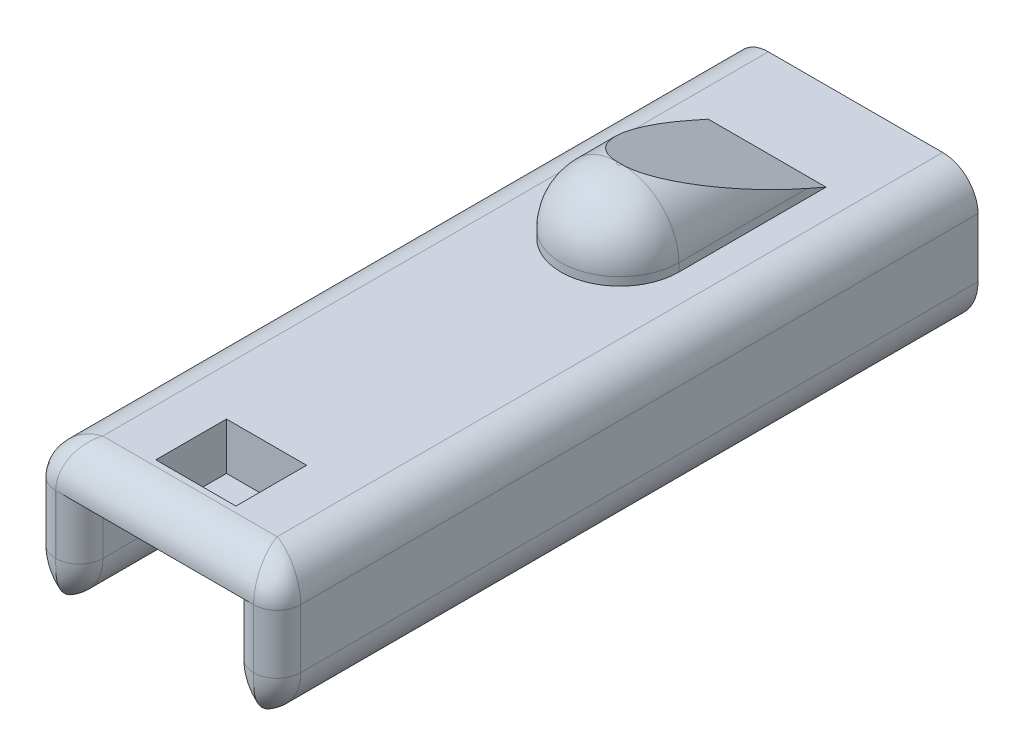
ISO-10303-21;
HEADER;
FILE_DESCRIPTION(('STEP AP214'),'2;1');
FILE_NAME('part.step','',(''),(''),'','','');
FILE_SCHEMA(('AUTOMOTIVE_DESIGN { 1 0 10303 214 1 1 1 1 }'));
ENDSEC;
DATA;
#1=APPLICATION_CONTEXT('core data for automotive mechanical design processes');
#2=APPLICATION_PROTOCOL_DEFINITION('international standard','automotive_design',2000,#1);
#3=PRODUCT_CONTEXT('',#1,'mechanical');
#4=PRODUCT('Part','Part','',(#3));
#5=PRODUCT_RELATED_PRODUCT_CATEGORY('part','',(#4));
#6=PRODUCT_DEFINITION_FORMATION('','',#4);
#7=PRODUCT_DEFINITION_CONTEXT('part definition',#1,'design');
#8=PRODUCT_DEFINITION('design','',#6,#7);
#9=PRODUCT_DEFINITION_SHAPE('','',#8);
#10=(LENGTH_UNIT() NAMED_UNIT(*) SI_UNIT(.MILLI.,.METRE.));
#11=(NAMED_UNIT(*) PLANE_ANGLE_UNIT() SI_UNIT($,.RADIAN.));
#12=(NAMED_UNIT(*) SI_UNIT($,.STERADIAN.) SOLID_ANGLE_UNIT());
#13=UNCERTAINTY_MEASURE_WITH_UNIT(LENGTH_MEASURE(1.E-05),#10,'distance_accuracy_value','');
#14=(GEOMETRIC_REPRESENTATION_CONTEXT(3) GLOBAL_UNCERTAINTY_ASSIGNED_CONTEXT((#13)) GLOBAL_UNIT_ASSIGNED_CONTEXT((#10,
#11,#12)) REPRESENTATION_CONTEXT('',''));
#15=CARTESIAN_POINT('',(0.,0.,0.));
#16=DIRECTION('',(0.,0.,1.));
#17=DIRECTION('',(1.,0.,0.));
#18=AXIS2_PLACEMENT_3D('',#15,#16,#17);
#19=CARTESIAN_POINT('',(-81.2225836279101,88.9,0.));
#20=DIRECTION('',(0.,1.,0.));
#21=DIRECTION('',(0.,0.,1.));
#22=AXIS2_PLACEMENT_3D('',#19,#20,#21);
#23=PLANE('',#22);
#24=DIRECTION('',(0.,0.,1.));
#25=VECTOR('',#24,1.);
#26=CARTESIAN_POINT('',(81.28,88.9,0.));
#27=LINE('',#26,#25);
#28=CARTESIAN_POINT('',(81.28,88.9,25.4));
#29=VERTEX_POINT('',#28);
#30=CARTESIAN_POINT('',(81.28,88.9,730.25));
#31=VERTEX_POINT('',#30);
#32=EDGE_CURVE('E353',#29,#31,#27,.T.);
#33=ORIENTED_EDGE('',*,*,#32,.T.);
#34=DIRECTION('',(-1.,0.,0.));
#35=VECTOR('',#34,1.);
#36=CARTESIAN_POINT('',(-106.62258362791,88.9,730.25));
#37=LINE('',#36,#35);
#38=CARTESIAN_POINT('',(-81.2225836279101,88.9,730.25));
#39=VERTEX_POINT('',#38);
#40=EDGE_CURVE('E596',#31,#39,#37,.T.);
#41=ORIENTED_EDGE('',*,*,#40,.T.);
#42=DIRECTION('',(0.,0.,1.));
#43=VECTOR('',#42,1.);
#44=CARTESIAN_POINT('',(-81.2225836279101,88.9,0.));
#45=LINE('',#44,#43);
#46=CARTESIAN_POINT('',(-81.2225836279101,88.9,25.4));
#47=VERTEX_POINT('',#46);
#48=EDGE_CURVE('E354',#47,#39,#45,.T.);
#49=ORIENTED_EDGE('',*,*,#48,.F.);
#50=DIRECTION('',(-1.,0.,0.));
#51=VECTOR('',#50,1.);
#52=CARTESIAN_POINT('',(81.28,88.9,25.4));
#53=LINE('',#52,#51);
#54=EDGE_CURVE('E287',#29,#47,#53,.T.);
#55=ORIENTED_EDGE('',*,*,#54,.F.);
#56=EDGE_LOOP('',(#33,#41,#49,#55));
#57=FACE_BOUND('',#56,.T.);
#58=ADVANCED_FACE('F45',(#57),#23,.F.);
#59=CARTESIAN_POINT('',(-132.08,152.4,755.65));
#60=DIRECTION('',(1.,0.,0.));
#61=DIRECTION('',(0.,1.,0.));
#62=AXIS2_PLACEMENT_3D('',#59,#60,#61);
#63=PLANE('',#62);
#64=DIRECTION('',(0.,-1.,0.));
#65=VECTOR('',#64,1.);
#66=CARTESIAN_POINT('',(-132.08,152.4,730.25));
#67=LINE('',#66,#65);
#68=CARTESIAN_POINT('',(-132.08,50.8,730.25));
#69=VERTEX_POINT('',#68);
#70=CARTESIAN_POINT('',(-132.08,114.3,730.25));
#71=VERTEX_POINT('',#70);
#72=EDGE_CURVE('E432',#69,#71,#67,.F.);
#73=ORIENTED_EDGE('',*,*,#72,.T.);
#74=DIRECTION('',(0.,0.,-1.));
#75=VECTOR('',#74,1.);
#76=CARTESIAN_POINT('',(-132.08,114.3,755.65));
#77=LINE('',#76,#75);
#78=CARTESIAN_POINT('',(-132.08,114.3,0.));
#79=VERTEX_POINT('',#78);
#80=EDGE_CURVE('E527',#71,#79,#77,.T.);
#81=ORIENTED_EDGE('',*,*,#80,.T.);
#82=DIRECTION('',(0.,-1.,0.));
#83=VECTOR('',#82,1.);
#84=CARTESIAN_POINT('',(-132.08,152.4,0.));
#85=LINE('',#84,#83);
#86=CARTESIAN_POINT('',(-132.08,50.8,0.));
#87=VERTEX_POINT('',#86);
#88=EDGE_CURVE('E358',#79,#87,#85,.T.);
#89=ORIENTED_EDGE('',*,*,#88,.T.);
#90=DIRECTION('',(0.,0.,-1.));
#91=VECTOR('',#90,1.);
#92=CARTESIAN_POINT('',(-132.08,50.8,755.65));
#93=LINE('',#92,#91);
#94=EDGE_CURVE('E397',#87,#69,#93,.F.);
#95=ORIENTED_EDGE('',*,*,#94,.T.);
#96=EDGE_LOOP('',(#73,#81,#89,#95));
#97=FACE_BOUND('',#96,.T.);
#98=ADVANCED_FACE('F654',(#97),#63,.F.);
#99=CARTESIAN_POINT('',(132.08,152.4,755.65));
#100=DIRECTION('',(-1.,0.,0.));
#101=DIRECTION('',(0.,-1.,0.));
#102=AXIS2_PLACEMENT_3D('',#99,#100,#101);
#103=PLANE('',#102);
#104=DIRECTION('',(0.,1.,0.));
#105=VECTOR('',#104,1.);
#106=CARTESIAN_POINT('',(132.08,152.4,0.));
#107=LINE('',#106,#105);
#108=CARTESIAN_POINT('',(132.08,50.8000000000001,0.));
#109=VERTEX_POINT('',#108);
#110=CARTESIAN_POINT('',(132.08,114.3,0.));
#111=VERTEX_POINT('',#110);
#112=EDGE_CURVE('E364',#109,#111,#107,.T.);
#113=ORIENTED_EDGE('',*,*,#112,.T.);
#114=DIRECTION('',(0.,0.,-1.));
#115=VECTOR('',#114,1.);
#116=CARTESIAN_POINT('',(132.08,114.3,755.65));
#117=LINE('',#116,#115);
#118=CARTESIAN_POINT('',(132.08,114.3,730.25));
#119=VERTEX_POINT('',#118);
#120=EDGE_CURVE('E520',#111,#119,#117,.F.);
#121=ORIENTED_EDGE('',*,*,#120,.T.);
#122=DIRECTION('',(0.,1.,0.));
#123=VECTOR('',#122,1.);
#124=CARTESIAN_POINT('',(132.08,50.8000000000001,730.25));
#125=LINE('',#124,#123);
#126=CARTESIAN_POINT('',(132.08,50.8,730.25));
#127=VERTEX_POINT('',#126);
#128=EDGE_CURVE('E439',#119,#127,#125,.F.);
#129=ORIENTED_EDGE('',*,*,#128,.T.);
#130=DIRECTION('',(0.,0.,-1.));
#131=VECTOR('',#130,1.);
#132=CARTESIAN_POINT('',(132.08,50.8,755.65));
#133=LINE('',#132,#131);
#134=EDGE_CURVE('E372',#127,#109,#133,.T.);
#135=ORIENTED_EDGE('',*,*,#134,.T.);
#136=EDGE_LOOP('',(#113,#121,#129,#135));
#137=FACE_BOUND('',#136,.T.);
#138=ADVANCED_FACE('F703',(#137),#103,.F.);
#139=CARTESIAN_POINT('',(-132.08,152.4,755.65));
#140=DIRECTION('',(0.,-1.,0.));
#141=DIRECTION('',(1.,0.,0.));
#142=AXIS2_PLACEMENT_3D('',#139,#140,#141);
#143=PLANE('',#142);
#144=DIRECTION('',(1.,0.,0.));
#145=VECTOR('',#144,1.);
#146=CARTESIAN_POINT('',(-43.18,152.4,711.2));
#147=LINE('',#146,#145);
#148=CARTESIAN_POINT('',(-43.18,152.4,711.2));
#149=VERTEX_POINT('',#148);
#150=CARTESIAN_POINT('',(43.1799999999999,152.4,711.2));
#151=VERTEX_POINT('',#150);
#152=EDGE_CURVE('E260',#149,#151,#147,.T.);
#153=ORIENTED_EDGE('',*,*,#152,.F.);
#154=DIRECTION('',(0.,0.,1.));
#155=VECTOR('',#154,1.);
#156=CARTESIAN_POINT('',(-43.18,152.4,635.));
#157=LINE('',#156,#155);
#158=CARTESIAN_POINT('',(-43.18,152.4,635.));
#159=VERTEX_POINT('',#158);
#160=EDGE_CURVE('E69',#159,#149,#157,.T.);
#161=ORIENTED_EDGE('',*,*,#160,.F.);
#162=DIRECTION('',(-1.,0.,0.));
#163=VECTOR('',#162,1.);
#164=CARTESIAN_POINT('',(-43.18,152.4,635.));
#165=LINE('',#164,#163);
#166=CARTESIAN_POINT('',(43.1799999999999,152.4,635.));
#167=VERTEX_POINT('',#166);
#168=EDGE_CURVE('E244',#167,#159,#165,.T.);
#169=ORIENTED_EDGE('',*,*,#168,.F.);
#170=DIRECTION('',(0.,0.,-1.));
#171=VECTOR('',#170,1.);
#172=CARTESIAN_POINT('',(43.1799999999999,152.4,635.));
#173=LINE('',#172,#171);
#174=EDGE_CURVE('E248',#151,#167,#173,.T.);
#175=ORIENTED_EDGE('',*,*,#174,.F.);
#176=EDGE_LOOP('',(#153,#161,#169,#175));
#177=FACE_BOUND('',#176,.T.);
#178=DIRECTION('',(-1.,0.,0.));
#179=VECTOR('',#178,1.);
#180=CARTESIAN_POINT('',(63.5,152.4,95.25));
#181=LINE('',#180,#179);
#182=CARTESIAN_POINT('',(63.5,152.4,95.25));
#183=VERTEX_POINT('',#182);
#184=CARTESIAN_POINT('',(-63.5,152.4,95.25));
#185=VERTEX_POINT('',#184);
#186=EDGE_CURVE('E319',#183,#185,#181,.T.);
#187=ORIENTED_EDGE('',*,*,#186,.F.);
#188=DIRECTION('',(0.,0.,-1.));
#189=VECTOR('',#188,1.);
#190=CARTESIAN_POINT('',(63.5,152.4,95.25));
#191=LINE('',#190,#189);
#192=CARTESIAN_POINT('',(63.5,152.4,254.));
#193=VERTEX_POINT('',#192);
#194=EDGE_CURVE('E311',#193,#183,#191,.T.);
#195=ORIENTED_EDGE('',*,*,#194,.F.);
#196=CARTESIAN_POINT('',(0.,152.4,254.));
#197=DIRECTION('',(0.,1.,0.));
#198=DIRECTION('',(-1.,0.,0.));
#199=AXIS2_PLACEMENT_3D('',#196,#197,#198);
#200=CIRCLE('',#199,63.5);
#201=CARTESIAN_POINT('',(-63.5,152.4,254.));
#202=VERTEX_POINT('',#201);
#203=EDGE_CURVE('E330',#202,#193,#200,.T.);
#204=ORIENTED_EDGE('',*,*,#203,.F.);
#205=DIRECTION('',(0.,0.,-1.));
#206=VECTOR('',#205,1.);
#207=CARTESIAN_POINT('',(-63.5,152.4,95.25));
#208=LINE('',#207,#206);
#209=EDGE_CURVE('E320',#202,#185,#208,.T.);
#210=ORIENTED_EDGE('',*,*,#209,.T.);
#211=EDGE_LOOP('',(#187,#195,#204,#210));
#212=FACE_BOUND('',#211,.T.);
#213=DIRECTION('',(-1.,0.,0.));
#214=VECTOR('',#213,1.);
#215=CARTESIAN_POINT('',(106.68,152.4,717.55));
#216=LINE('',#215,#214);
#217=CARTESIAN_POINT('',(-93.98,152.4,717.55));
#218=VERTEX_POINT('',#217);
#219=CARTESIAN_POINT('',(93.9799999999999,152.4,717.55));
#220=VERTEX_POINT('',#219);
#221=EDGE_CURVE('E448',#218,#220,#216,.F.);
#222=ORIENTED_EDGE('',*,*,#221,.T.);
#223=DIRECTION('',(0.,0.,-1.));
#224=VECTOR('',#223,1.);
#225=CARTESIAN_POINT('',(93.9799999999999,152.4,755.65));
#226=LINE('',#225,#224);
#227=CARTESIAN_POINT('',(93.9799999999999,152.4,0.));
#228=VERTEX_POINT('',#227);
#229=EDGE_CURVE('E510',#220,#228,#226,.T.);
#230=ORIENTED_EDGE('',*,*,#229,.T.);
#231=DIRECTION('',(-1.,0.,0.));
#232=VECTOR('',#231,1.);
#233=CARTESIAN_POINT('',(-132.08,152.4,0.));
#234=LINE('',#233,#232);
#235=CARTESIAN_POINT('',(-93.98,152.4,0.));
#236=VERTEX_POINT('',#235);
#237=EDGE_CURVE('E368',#228,#236,#234,.T.);
#238=ORIENTED_EDGE('',*,*,#237,.T.);
#239=DIRECTION('',(0.,0.,-1.));
#240=VECTOR('',#239,1.);
#241=CARTESIAN_POINT('',(-93.98,152.4,755.65));
#242=LINE('',#241,#240);
#243=EDGE_CURVE('E507',#236,#218,#242,.F.);
#244=ORIENTED_EDGE('',*,*,#243,.T.);
#245=EDGE_LOOP('',(#222,#230,#238,#244));
#246=FACE_BOUND('',#245,.T.);
#247=ADVANCED_FACE('F716',(#177,#212,#246),#143,.F.);
#248=CARTESIAN_POINT('',(0.,0.,755.65));
#249=DIRECTION('',(0.,0.,1.));
#250=DIRECTION('',(1.,0.,0.));
#251=AXIS2_PLACEMENT_3D('',#248,#249,#250);
#252=PLANE('',#251);
#253=DIRECTION('',(0.,-1.,0.));
#254=VECTOR('',#253,1.);
#255=CARTESIAN_POINT('',(-106.62258362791,88.9,755.65));
#256=LINE('',#255,#254);
#257=CARTESIAN_POINT('',(-106.62258362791,50.8,755.65));
#258=VERTEX_POINT('',#257);
#259=CARTESIAN_POINT('',(-106.62258362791,114.3,755.65));
#260=VERTEX_POINT('',#259);
#261=EDGE_CURVE('E61',#258,#260,#256,.F.);
#262=ORIENTED_EDGE('',*,*,#261,.T.);
#263=DIRECTION('',(-1.,0.,0.));
#264=VECTOR('',#263,1.);
#265=CARTESIAN_POINT('',(-106.68,114.3,755.65));
#266=LINE('',#265,#264);
#267=CARTESIAN_POINT('',(-106.68,114.3,755.65));
#268=VERTEX_POINT('',#267);
#269=EDGE_CURVE('E533',#260,#268,#266,.T.);
#270=ORIENTED_EDGE('',*,*,#269,.T.);
#271=DIRECTION('',(0.,-1.,0.));
#272=VECTOR('',#271,1.);
#273=CARTESIAN_POINT('',(-106.68,50.8,755.65));
#274=LINE('',#273,#272);
#275=CARTESIAN_POINT('',(-106.68,50.8,755.65));
#276=VERTEX_POINT('',#275);
#277=EDGE_CURVE('E417',#268,#276,#274,.T.);
#278=ORIENTED_EDGE('',*,*,#277,.T.);
#279=CARTESIAN_POINT('',(-81.28,50.8,755.65));
#280=DIRECTION('',(0.,0.,1.));
#281=DIRECTION('',(1.,0.,0.));
#282=AXIS2_PLACEMENT_3D('',#279,#280,#281);
#283=CIRCLE('',#282,25.4);
#284=CARTESIAN_POINT('',(-106.651291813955,49.592708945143,755.65));
#285=VERTEX_POINT('',#284);
#286=EDGE_CURVE('E411',#276,#285,#283,.T.);
#287=ORIENTED_EDGE('',*,*,#286,.T.);
#288=CARTESIAN_POINT('',(-132.02258362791,50.8,755.65));
#289=DIRECTION('',(0.,0.,1.));
#290=DIRECTION('',(1.,0.,0.));
#291=AXIS2_PLACEMENT_3D('',#288,#289,#290);
#292=CIRCLE('',#291,25.4);
#293=EDGE_CURVE('E414',#285,#258,#292,.T.);
#294=ORIENTED_EDGE('',*,*,#293,.T.);
#295=EDGE_LOOP('',(#262,#270,#278,#287,#294));
#296=FACE_BOUND('',#295,.T.);
#297=ADVANCED_FACE('F671',(#296),#252,.T.);
#298=CARTESIAN_POINT('',(0.,0.,0.));
#299=DIRECTION('',(0.,0.,1.));
#300=DIRECTION('',(1.,0.,0.));
#301=AXIS2_PLACEMENT_3D('',#298,#299,#300);
#302=PLANE('',#301);
#303=DIRECTION('',(0.,1.,0.));
#304=VECTOR('',#303,1.);
#305=CARTESIAN_POINT('',(81.28,0.,0.));
#306=LINE('',#305,#304);
#307=CARTESIAN_POINT('',(81.28,50.8,0.));
#308=VERTEX_POINT('',#307);
#309=CARTESIAN_POINT('',(81.28,119.38,0.));
#310=VERTEX_POINT('',#309);
#311=EDGE_CURVE('E349',#308,#310,#306,.T.);
#312=ORIENTED_EDGE('',*,*,#311,.T.);
#313=DIRECTION('',(1.,0.,0.));
#314=VECTOR('',#313,1.);
#315=CARTESIAN_POINT('',(81.28,119.38,0.));
#316=LINE('',#315,#314);
#317=CARTESIAN_POINT('',(-81.2225836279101,119.38,0.));
#318=VERTEX_POINT('',#317);
#319=EDGE_CURVE('E280',#318,#310,#316,.T.);
#320=ORIENTED_EDGE('',*,*,#319,.F.);
#321=DIRECTION('',(0.,-1.,0.));
#322=VECTOR('',#321,1.);
#323=CARTESIAN_POINT('',(-81.2225836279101,0.,0.));
#324=LINE('',#323,#322);
#325=CARTESIAN_POINT('',(-81.2225836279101,50.8,0.));
#326=VERTEX_POINT('',#325);
#327=EDGE_CURVE('E345',#318,#326,#324,.T.);
#328=ORIENTED_EDGE('',*,*,#327,.T.);
#329=CARTESIAN_POINT('',(-132.02258362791,50.8,0.));
#330=DIRECTION('',(0.,0.,1.));
#331=DIRECTION('',(1.,0.,0.));
#332=AXIS2_PLACEMENT_3D('',#329,#330,#331);
#333=CIRCLE('',#332,50.8);
#334=CARTESIAN_POINT('',(-106.651291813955,6.78934729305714,0.));
#335=VERTEX_POINT('',#334);
#336=EDGE_CURVE('E379',#326,#335,#333,.F.);
#337=ORIENTED_EDGE('',*,*,#336,.T.);
#338=CARTESIAN_POINT('',(-81.28,50.8,0.));
#339=DIRECTION('',(0.,0.,1.));
#340=DIRECTION('',(1.,0.,0.));
#341=AXIS2_PLACEMENT_3D('',#338,#339,#340);
#342=CIRCLE('',#341,50.8);
#343=EDGE_CURVE('E375',#335,#87,#342,.F.);
#344=ORIENTED_EDGE('',*,*,#343,.T.);
#345=ORIENTED_EDGE('',*,*,#88,.F.);
#346=CARTESIAN_POINT('',(-93.98,114.3,0.));
#347=DIRECTION('',(0.,0.,1.));
#348=DIRECTION('',(1.,0.,0.));
#349=AXIS2_PLACEMENT_3D('',#346,#347,#348);
#350=CIRCLE('',#349,38.1);
#351=EDGE_CURVE('E514',#79,#236,#350,.F.);
#352=ORIENTED_EDGE('',*,*,#351,.T.);
#353=ORIENTED_EDGE('',*,*,#237,.F.);
#354=CARTESIAN_POINT('',(93.9799999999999,114.3,0.));
#355=DIRECTION('',(0.,0.,1.));
#356=DIRECTION('',(1.,0.,0.));
#357=AXIS2_PLACEMENT_3D('',#354,#355,#356);
#358=CIRCLE('',#357,38.1);
#359=EDGE_CURVE('E517',#228,#111,#358,.F.);
#360=ORIENTED_EDGE('',*,*,#359,.T.);
#361=ORIENTED_EDGE('',*,*,#112,.F.);
#362=CARTESIAN_POINT('',(81.28,50.8,0.));
#363=DIRECTION('',(0.,0.,1.));
#364=DIRECTION('',(1.,0.,0.));
#365=AXIS2_PLACEMENT_3D('',#362,#363,#364);
#366=CIRCLE('',#365,50.8);
#367=CARTESIAN_POINT('',(106.68,6.80590948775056,0.));
#368=VERTEX_POINT('',#367);
#369=EDGE_CURVE('E386',#109,#368,#366,.F.);
#370=ORIENTED_EDGE('',*,*,#369,.T.);
#371=CARTESIAN_POINT('',(132.08,50.8,0.));
#372=DIRECTION('',(0.,0.,1.));
#373=DIRECTION('',(1.,0.,0.));
#374=AXIS2_PLACEMENT_3D('',#371,#372,#373);
#375=CIRCLE('',#374,50.8);
#376=EDGE_CURVE('E383',#368,#308,#375,.F.);
#377=ORIENTED_EDGE('',*,*,#376,.T.);
#378=EDGE_LOOP('',(#312,#320,#328,#337,#344,#345,#352,#353,#360,#361,#370,#377));
#379=FACE_BOUND('',#378,.T.);
#380=ADVANCED_FACE('F657',(#379),#302,.F.);
#381=CARTESIAN_POINT('',(-81.2225836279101,0.,0.));
#382=DIRECTION('',(-1.,0.,0.));
#383=DIRECTION('',(0.,0.,1.));
#384=AXIS2_PLACEMENT_3D('',#381,#382,#383);
#385=PLANE('',#384);
#386=ORIENTED_EDGE('',*,*,#327,.F.);
#387=DIRECTION('',(0.,0.,-1.));
#388=VECTOR('',#387,1.);
#389=CARTESIAN_POINT('',(-81.2225836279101,119.38,25.4));
#390=LINE('',#389,#388);
#391=CARTESIAN_POINT('',(-81.2225836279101,119.38,25.4));
#392=VERTEX_POINT('',#391);
#393=EDGE_CURVE('E299',#392,#318,#390,.T.);
#394=ORIENTED_EDGE('',*,*,#393,.F.);
#395=DIRECTION('',(0.,1.,0.));
#396=VECTOR('',#395,1.);
#397=CARTESIAN_POINT('',(-81.2225836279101,119.38,25.4));
#398=LINE('',#397,#396);
#399=EDGE_CURVE('E291',#47,#392,#398,.T.);
#400=ORIENTED_EDGE('',*,*,#399,.F.);
#401=ORIENTED_EDGE('',*,*,#48,.T.);
#402=DIRECTION('',(0.,-1.,0.));
#403=VECTOR('',#402,1.);
#404=CARTESIAN_POINT('',(-81.2225836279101,50.8,730.25));
#405=LINE('',#404,#403);
#406=CARTESIAN_POINT('',(-81.2225836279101,50.8,730.25));
#407=VERTEX_POINT('',#406);
#408=EDGE_CURVE('E428',#39,#407,#405,.T.);
#409=ORIENTED_EDGE('',*,*,#408,.T.);
#410=DIRECTION('',(0.,0.,1.));
#411=VECTOR('',#410,1.);
#412=CARTESIAN_POINT('',(-81.2225836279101,50.8,0.));
#413=LINE('',#412,#411);
#414=EDGE_CURVE('E394',#407,#326,#413,.F.);
#415=ORIENTED_EDGE('',*,*,#414,.T.);
#416=EDGE_LOOP('',(#386,#394,#400,#401,#409,#415));
#417=FACE_BOUND('',#416,.T.);
#418=ADVANCED_FACE('F677',(#417),#385,.F.);
#419=CARTESIAN_POINT('',(81.28,0.,0.));
#420=DIRECTION('',(1.,0.,0.));
#421=DIRECTION('',(0.,0.,-1.));
#422=AXIS2_PLACEMENT_3D('',#419,#420,#421);
#423=PLANE('',#422);
#424=DIRECTION('',(0.,0.,1.));
#425=VECTOR('',#424,1.);
#426=CARTESIAN_POINT('',(81.28,50.8,0.));
#427=LINE('',#426,#425);
#428=CARTESIAN_POINT('',(81.28,50.8,730.25));
#429=VERTEX_POINT('',#428);
#430=EDGE_CURVE('E390',#308,#429,#427,.T.);
#431=ORIENTED_EDGE('',*,*,#430,.T.);
#432=DIRECTION('',(0.,1.,0.));
#433=VECTOR('',#432,1.);
#434=CARTESIAN_POINT('',(81.28,88.9,730.25));
#435=LINE('',#434,#433);
#436=EDGE_CURVE('E401',#429,#31,#435,.T.);
#437=ORIENTED_EDGE('',*,*,#436,.T.);
#438=ORIENTED_EDGE('',*,*,#32,.F.);
#439=DIRECTION('',(0.,-1.,0.));
#440=VECTOR('',#439,1.);
#441=CARTESIAN_POINT('',(81.28,119.38,25.4));
#442=LINE('',#441,#440);
#443=CARTESIAN_POINT('',(81.28,119.38,25.4));
#444=VERTEX_POINT('',#443);
#445=EDGE_CURVE('E284',#444,#29,#442,.T.);
#446=ORIENTED_EDGE('',*,*,#445,.F.);
#447=DIRECTION('',(0.,0.,-1.));
#448=VECTOR('',#447,1.);
#449=CARTESIAN_POINT('',(81.28,119.38,25.4));
#450=LINE('',#449,#448);
#451=EDGE_CURVE('E303',#444,#310,#450,.T.);
#452=ORIENTED_EDGE('',*,*,#451,.T.);
#453=ORIENTED_EDGE('',*,*,#311,.F.);
#454=EDGE_LOOP('',(#431,#437,#438,#446,#452,#453));
#455=FACE_BOUND('',#454,.T.);
#456=ADVANCED_FACE('F628',(#455),#423,.F.);
#457=CARTESIAN_POINT('',(132.08,50.8,0.));
#458=DIRECTION('',(0.,0.,1.));
#459=DIRECTION('',(1.,0.,0.));
#460=AXIS2_PLACEMENT_3D('',#457,#458,#459);
#461=CYLINDRICAL_SURFACE('',#460,50.8);
#462=DIRECTION('',(0.,0.,1.));
#463=VECTOR('',#462,1.);
#464=CARTESIAN_POINT('',(106.68,6.80590948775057,377.825));
#465=LINE('',#464,#463);
#466=CARTESIAN_POINT('',(106.68,6.80590948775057,730.25));
#467=VERTEX_POINT('',#466);
#468=EDGE_CURVE('E350',#467,#368,#465,.F.);
#469=ORIENTED_EDGE('',*,*,#468,.F.);
#470=CARTESIAN_POINT('',(132.08,50.8,730.25));
#471=DIRECTION('',(0.,0.,1.));
#472=DIRECTION('',(1.,0.,0.));
#473=AXIS2_PLACEMENT_3D('',#470,#471,#472);
#474=CIRCLE('',#473,50.8);
#475=EDGE_CURVE('E436',#467,#429,#474,.F.);
#476=ORIENTED_EDGE('',*,*,#475,.T.);
#477=ORIENTED_EDGE('',*,*,#430,.F.);
#478=ORIENTED_EDGE('',*,*,#376,.F.);
#479=EDGE_LOOP('',(#469,#476,#477,#478));
#480=FACE_BOUND('',#479,.T.);
#481=ADVANCED_FACE('F711',(#480),#461,.T.);
#482=CARTESIAN_POINT('',(81.28,50.8,755.65));
#483=DIRECTION('',(0.,0.,-1.));
#484=DIRECTION('',(-1.,0.,0.));
#485=AXIS2_PLACEMENT_3D('',#482,#483,#484);
#486=CYLINDRICAL_SURFACE('',#485,50.8);
#487=ORIENTED_EDGE('',*,*,#134,.F.);
#488=CARTESIAN_POINT('',(81.28,50.8,730.25));
#489=DIRECTION('',(0.,0.,1.));
#490=DIRECTION('',(1.,0.,0.));
#491=AXIS2_PLACEMENT_3D('',#488,#489,#490);
#492=CIRCLE('',#491,50.8);
#493=EDGE_CURVE('E425',#127,#467,#492,.F.);
#494=ORIENTED_EDGE('',*,*,#493,.T.);
#495=ORIENTED_EDGE('',*,*,#468,.T.);
#496=ORIENTED_EDGE('',*,*,#369,.F.);
#497=EDGE_LOOP('',(#487,#494,#495,#496));
#498=FACE_BOUND('',#497,.T.);
#499=ADVANCED_FACE('F725',(#498),#486,.T.);
#500=CARTESIAN_POINT('',(-81.28,50.8,755.65));
#501=DIRECTION('',(0.,0.,-1.));
#502=DIRECTION('',(-1.,0.,0.));
#503=AXIS2_PLACEMENT_3D('',#500,#501,#502);
#504=CYLINDRICAL_SURFACE('',#503,50.8);
#505=DIRECTION('',(0.,0.,-1.));
#506=VECTOR('',#505,1.);
#507=CARTESIAN_POINT('',(-106.651291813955,6.78934729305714,377.825));
#508=LINE('',#507,#506);
#509=CARTESIAN_POINT('',(-106.651291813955,6.78934729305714,730.25));
#510=VERTEX_POINT('',#509);
#511=EDGE_CURVE('E404',#510,#335,#508,.T.);
#512=ORIENTED_EDGE('',*,*,#511,.F.);
#513=CARTESIAN_POINT('',(-81.28,50.8,730.25));
#514=DIRECTION('',(0.,0.,1.));
#515=DIRECTION('',(1.,0.,0.));
#516=AXIS2_PLACEMENT_3D('',#513,#514,#515);
#517=CIRCLE('',#516,50.8);
#518=EDGE_CURVE('E445',#510,#69,#517,.F.);
#519=ORIENTED_EDGE('',*,*,#518,.T.);
#520=ORIENTED_EDGE('',*,*,#94,.F.);
#521=ORIENTED_EDGE('',*,*,#343,.F.);
#522=EDGE_LOOP('',(#512,#519,#520,#521));
#523=FACE_BOUND('',#522,.T.);
#524=ADVANCED_FACE('F664',(#523),#504,.T.);
#525=CARTESIAN_POINT('',(-132.02258362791,50.8,755.65));
#526=DIRECTION('',(0.,0.,1.));
#527=DIRECTION('',(1.,0.,0.));
#528=AXIS2_PLACEMENT_3D('',#525,#526,#527);
#529=CYLINDRICAL_SURFACE('',#528,50.8);
#530=ORIENTED_EDGE('',*,*,#414,.F.);
#531=CARTESIAN_POINT('',(-132.02258362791,50.8,730.25));
#532=DIRECTION('',(0.,0.,1.));
#533=DIRECTION('',(1.,0.,0.));
#534=AXIS2_PLACEMENT_3D('',#531,#532,#533);
#535=CIRCLE('',#534,50.8);
#536=EDGE_CURVE('E442',#407,#510,#535,.F.);
#537=ORIENTED_EDGE('',*,*,#536,.T.);
#538=ORIENTED_EDGE('',*,*,#511,.T.);
#539=ORIENTED_EDGE('',*,*,#336,.F.);
#540=EDGE_LOOP('',(#530,#537,#538,#539));
#541=FACE_BOUND('',#540,.T.);
#542=ADVANCED_FACE('F473',(#541),#529,.T.);
#543=CARTESIAN_POINT('',(81.28,50.8,730.25));
#544=DIRECTION('',(0.,0.,1.));
#545=DIRECTION('',(1.,0.,0.));
#546=AXIS2_PLACEMENT_3D('',#543,#544,#545);
#547=DEGENERATE_TOROIDAL_SURFACE('',#546,25.4,25.4,.T.);
#548=CARTESIAN_POINT('',(106.68,6.80590948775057,730.25));
#549=CARTESIAN_POINT('',(106.68,6.8059078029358,730.567005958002));
#550=CARTESIAN_POINT('',(106.68,6.81276320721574,730.883974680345));
#551=CARTESIAN_POINT('',(106.68,6.840156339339,731.517310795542));
#552=CARTESIAN_POINT('',(106.68,6.86069365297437,731.833678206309));
#553=CARTESIAN_POINT('',(106.68,6.9427590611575,732.780860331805));
#554=CARTESIAN_POINT('',(106.68,7.02474067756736,733.410013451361));
#555=CARTESIAN_POINT('',(106.68,7.24214873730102,734.657237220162));
#556=CARTESIAN_POINT('',(106.68,7.37742905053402,735.275333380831));
#557=CARTESIAN_POINT('',(106.68,7.61933730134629,736.191998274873));
#558=CARTESIAN_POINT('',(106.68,7.70647764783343,736.495824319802));
#559=CARTESIAN_POINT('',(106.68,7.89356508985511,737.099586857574));
#560=CARTESIAN_POINT('',(106.68,7.99351522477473,737.399522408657));
#561=CARTESIAN_POINT('',(106.68,8.31211192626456,738.292352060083));
#562=CARTESIAN_POINT('',(106.68,8.54960021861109,738.878629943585));
#563=CARTESIAN_POINT('',(106.68,9.0724963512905,740.029409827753));
#564=CARTESIAN_POINT('',(106.68,9.357906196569,740.593910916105));
#565=CARTESIAN_POINT('',(106.68,9.81989090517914,741.421685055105));
#566=CARTESIAN_POINT('',(106.68,9.97957164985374,741.694507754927));
#567=CARTESIAN_POINT('',(106.68,10.3098224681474,742.233382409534));
#568=CARTESIAN_POINT('',(106.68,10.4803896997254,742.499436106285));
#569=CARTESIAN_POINT('',(106.68,11.0079540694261,743.287039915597));
#570=CARTESIAN_POINT('',(106.68,11.3808326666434,743.798066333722));
#571=CARTESIAN_POINT('',(106.68,12.1765974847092,744.803204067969));
#572=CARTESIAN_POINT('',(106.68,12.6005994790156,745.296428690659));
#573=CARTESIAN_POINT('',(106.68,13.4860466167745,746.248018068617));
#574=CARTESIAN_POINT('',(106.68,13.9474922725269,746.706382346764));
#575=CARTESIAN_POINT('',(106.68,14.9041407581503,747.586747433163));
#576=CARTESIAN_POINT('',(106.68,15.3993569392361,748.008733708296));
#577=CARTESIAN_POINT('',(106.68,16.4194924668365,748.815080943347));
#578=CARTESIAN_POINT('',(106.68,16.9444129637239,749.199440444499));
#579=CARTESIAN_POINT('',(106.68,18.0747805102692,749.967159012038));
#580=CARTESIAN_POINT('',(106.68,18.6829906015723,750.346449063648));
#581=CARTESIAN_POINT('',(106.68,19.9258162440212,751.058873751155));
#582=CARTESIAN_POINT('',(106.68,20.5604333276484,751.392005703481));
#583=CARTESIAN_POINT('',(106.68,21.8509935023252,752.012835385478));
#584=CARTESIAN_POINT('',(106.68,22.5069242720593,752.300558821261));
#585=CARTESIAN_POINT('',(106.68,23.8361892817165,752.832448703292));
#586=CARTESIAN_POINT('',(106.68,24.5095245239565,753.076612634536));
#587=CARTESIAN_POINT('',(106.68,25.7929061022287,753.498429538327));
#588=CARTESIAN_POINT('',(106.68,26.4015196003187,753.680478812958));
#589=CARTESIAN_POINT('',(106.68,27.6271061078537,754.014127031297));
#590=CARTESIAN_POINT('',(106.68,28.2440804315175,754.165721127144));
#591=CARTESIAN_POINT('',(106.68,29.4845592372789,754.440814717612));
#592=CARTESIAN_POINT('',(106.68,30.108067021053,754.564299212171));
#593=CARTESIAN_POINT('',(106.68,31.3596515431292,754.785699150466));
#594=CARTESIAN_POINT('',(106.68,31.9877288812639,754.88361117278));
#595=CARTESIAN_POINT('',(106.68,33.2491965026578,755.05700040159));
#596=CARTESIAN_POINT('',(106.68,33.8825977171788,755.132397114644));
#597=CARTESIAN_POINT('',(106.68,35.1514735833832,755.263360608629));
#598=CARTESIAN_POINT('',(106.68,35.7869484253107,755.318925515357));
#599=CARTESIAN_POINT('',(106.68,37.0589598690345,755.413391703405));
#600=CARTESIAN_POINT('',(106.68,37.6954961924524,755.452296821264));
#601=CARTESIAN_POINT('',(106.68,38.9692082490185,755.516682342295));
#602=CARTESIAN_POINT('',(106.68,39.6063839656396,755.54216308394));
#603=CARTESIAN_POINT('',(106.68,41.1050316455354,755.590028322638));
#604=CARTESIAN_POINT('',(106.68,41.9666325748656,755.608177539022));
#605=CARTESIAN_POINT('',(106.68,43.6898874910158,755.633037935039));
#606=CARTESIAN_POINT('',(106.68,44.5515414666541,755.639750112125));
#607=CARTESIAN_POINT('',(106.68,45.8433158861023,755.645696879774));
#608=CARTESIAN_POINT('',(106.68,46.2734303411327,755.646992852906));
#609=CARTESIAN_POINT('',(106.68,47.1336604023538,755.648765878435));
#610=CARTESIAN_POINT('',(106.68,47.5637760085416,755.649242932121));
#611=CARTESIAN_POINT('',(106.68,48.4240115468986,755.64981686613));
#612=CARTESIAN_POINT('',(106.68,48.8541314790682,755.649913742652));
#613=CARTESIAN_POINT('',(106.68,49.7143714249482,755.650005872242));
#614=CARTESIAN_POINT('',(106.68,50.1444914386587,755.650001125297));
#615=CARTESIAN_POINT('',(106.68,50.6497409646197,755.649999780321));
#616=CARTESIAN_POINT('',(106.68,50.7248704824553,755.649999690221));
#617=CARTESIAN_POINT('',(106.68,50.8,755.65));
#618=B_SPLINE_CURVE_WITH_KNOTS('',3,(#548,#549,#550,#551,#552,#553,#554,#555,#556,#557,#558,
#559,#560,#561,#562,#563,#564,#565,#566,#567,#568,#569,#570,#571,#572,#573,#574,#575,#576,#577,
#578,#579,#580,#581,#582,#583,#584,#585,#586,#587,#588,#589,#590,#591,#592,#593,#594,#595,#596,
#597,#598,#599,#600,#601,#602,#603,#604,#605,#606,#607,#608,#609,#610,#611,#612,#613,#614,#615,
#616,#617),.UNSPECIFIED.,.F.,.F.,(4,2,2,2,2,2,2,2,2,2,2,2,2,2,2,2,2,2,2,2,2,2,2,2,2,2,2,2,2,2,2,
2,2,2,4),(0.,0.950869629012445,1.90171047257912,3.80261926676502,5.69835217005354,
6.64633062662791,7.59453442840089,9.48982610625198,11.3851970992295,12.333321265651,
13.2811989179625,15.1768391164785,17.1260729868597,19.0753335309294,21.0253692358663,
22.9754805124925,25.1237180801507,27.2720804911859,29.4192223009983,31.5664880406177,
33.4714352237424,35.3766853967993,37.2829498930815,39.1894693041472,41.1027251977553,
43.0161618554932,44.9291576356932,46.8421051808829,49.4273397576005,52.0123488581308,
53.3026978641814,54.5930448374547,55.8834047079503,57.1737647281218,57.3991532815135),.UNSPECIFIED.);
#619=CARTESIAN_POINT('',(106.68,50.8,755.65));
#620=VERTEX_POINT('',#619);
#621=EDGE_CURVE('E453',#467,#620,#618,.T.);
#622=ORIENTED_EDGE('',*,*,#621,.F.);
#623=ORIENTED_EDGE('',*,*,#493,.F.);
#624=CARTESIAN_POINT('',(106.68,50.8,730.25));
#625=DIRECTION('',(0.,1.,0.));
#626=DIRECTION('',(0.,0.,1.));
#627=AXIS2_PLACEMENT_3D('',#624,#625,#626);
#628=CIRCLE('',#627,25.4);
#629=EDGE_CURVE('E407',#620,#127,#628,.T.);
#630=ORIENTED_EDGE('',*,*,#629,.F.);
#631=EDGE_LOOP('',(#622,#623,#630));
#632=FACE_BOUND('',#631,.T.);
#633=ADVANCED_FACE('F468',(#632),#547,.T.);
#634=CARTESIAN_POINT('',(106.68,0.,730.25));
#635=DIRECTION('',(0.,-1.,0.));
#636=DIRECTION('',(1.,0.,0.));
#637=AXIS2_PLACEMENT_3D('',#634,#635,#636);
#638=CYLINDRICAL_SURFACE('',#637,25.4);
#639=ORIENTED_EDGE('',*,*,#128,.F.);
#640=CARTESIAN_POINT('',(106.68,114.3,730.25));
#641=DIRECTION('',(0.,-1.,0.));
#642=DIRECTION('',(0.,0.,-1.));
#643=AXIS2_PLACEMENT_3D('',#640,#641,#642);
#644=CIRCLE('',#643,25.4);
#645=CARTESIAN_POINT('',(106.68,114.3,755.65));
#646=VERTEX_POINT('',#645);
#647=EDGE_CURVE('E523',#119,#646,#644,.T.);
#648=ORIENTED_EDGE('',*,*,#647,.T.);
#649=DIRECTION('',(0.,1.,0.));
#650=VECTOR('',#649,1.);
#651=CARTESIAN_POINT('',(106.68,152.4,755.65));
#652=LINE('',#651,#650);
#653=EDGE_CURVE('E422',#620,#646,#652,.T.);
#654=ORIENTED_EDGE('',*,*,#653,.F.);
#655=ORIENTED_EDGE('',*,*,#629,.T.);
#656=EDGE_LOOP('',(#639,#648,#654,#655));
#657=FACE_BOUND('',#656,.T.);
#658=ADVANCED_FACE('F472',(#657),#638,.T.);
#659=CARTESIAN_POINT('',(132.08,50.8,730.25));
#660=DIRECTION('',(0.,0.,1.));
#661=DIRECTION('',(1.,0.,0.));
#662=AXIS2_PLACEMENT_3D('',#659,#660,#661);
#663=DEGENERATE_TOROIDAL_SURFACE('',#662,25.4,25.4,.T.);
#664=ORIENTED_EDGE('',*,*,#475,.F.);
#665=ORIENTED_EDGE('',*,*,#621,.T.);
#666=CARTESIAN_POINT('',(106.68,50.8,730.25));
#667=DIRECTION('',(0.,1.,0.));
#668=DIRECTION('',(0.,0.,1.));
#669=AXIS2_PLACEMENT_3D('',#666,#667,#668);
#670=CIRCLE('',#669,25.4);
#671=EDGE_CURVE('E449',#429,#620,#670,.T.);
#672=ORIENTED_EDGE('',*,*,#671,.F.);
#673=EDGE_LOOP('',(#664,#665,#672));
#674=FACE_BOUND('',#673,.T.);
#675=ADVANCED_FACE('F465',(#674),#663,.T.);
#676=CARTESIAN_POINT('',(106.68,0.,730.25));
#677=DIRECTION('',(0.,-1.,0.));
#678=DIRECTION('',(0.,0.,-1.));
#679=AXIS2_PLACEMENT_3D('',#676,#677,#678);
#680=CYLINDRICAL_SURFACE('',#679,25.4);
#681=ORIENTED_EDGE('',*,*,#671,.T.);
#682=ORIENTED_EDGE('',*,*,#653,.T.);
#683=CARTESIAN_POINT('',(106.68,88.8999999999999,730.25));
#684=DIRECTION('',(0.,-0.707106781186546,0.707106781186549));
#685=DIRECTION('',(0.,-0.707106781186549,-0.707106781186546));
#686=AXIS2_PLACEMENT_3D('',#683,#684,#685);
#687=ELLIPSE('',#686,35.9210244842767,25.4);
#688=EDGE_CURVE('E11',#646,#31,#687,.T.);
#689=ORIENTED_EDGE('',*,*,#688,.T.);
#690=ORIENTED_EDGE('',*,*,#436,.F.);
#691=EDGE_LOOP('',(#681,#682,#689,#690));
#692=FACE_BOUND('',#691,.T.);
#693=ADVANCED_FACE('F621',(#692),#680,.T.);
#694=CARTESIAN_POINT('',(-106.68,0.,730.25));
#695=DIRECTION('',(0.,1.,0.));
#696=DIRECTION('',(-1.,0.,0.));
#697=AXIS2_PLACEMENT_3D('',#694,#695,#696);
#698=CYLINDRICAL_SURFACE('',#697,25.4);
#699=ORIENTED_EDGE('',*,*,#277,.F.);
#700=CARTESIAN_POINT('',(-106.68,114.3,730.25));
#701=DIRECTION('',(0.,-1.,0.));
#702=DIRECTION('',(0.,0.,-1.));
#703=AXIS2_PLACEMENT_3D('',#700,#701,#702);
#704=CIRCLE('',#703,25.4);
#705=EDGE_CURVE('E530',#268,#71,#704,.T.);
#706=ORIENTED_EDGE('',*,*,#705,.T.);
#707=ORIENTED_EDGE('',*,*,#72,.F.);
#708=CARTESIAN_POINT('',(-106.68,50.8,730.25));
#709=DIRECTION('',(0.,-1.,0.));
#710=DIRECTION('',(1.,0.,0.));
#711=AXIS2_PLACEMENT_3D('',#708,#709,#710);
#712=CIRCLE('',#711,25.4);
#713=EDGE_CURVE('E454',#276,#69,#712,.T.);
#714=ORIENTED_EDGE('',*,*,#713,.F.);
#715=EDGE_LOOP('',(#699,#706,#707,#714));
#716=FACE_BOUND('',#715,.T.);
#717=ADVANCED_FACE('F488',(#716),#698,.T.);
#718=CARTESIAN_POINT('',(-81.28,50.8,730.25));
#719=DIRECTION('',(0.,0.,1.));
#720=DIRECTION('',(1.,0.,0.));
#721=AXIS2_PLACEMENT_3D('',#718,#719,#720);
#722=DEGENERATE_TOROIDAL_SURFACE('',#721,25.4,25.4,.T.);
#723=ORIENTED_EDGE('',*,*,#713,.T.);
#724=ORIENTED_EDGE('',*,*,#518,.F.);
#725=CARTESIAN_POINT('',(-106.651291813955,6.78934729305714,730.25));
#726=CARTESIAN_POINT('',(-106.651291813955,6.78934561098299,730.567103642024));
#727=CARTESIAN_POINT('',(-106.651291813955,6.79620265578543,730.884170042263));
#728=CARTESIAN_POINT('',(-106.651291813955,6.82360236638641,731.517701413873));
#729=CARTESIAN_POINT('',(-106.651291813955,6.84414461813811,731.834166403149));
#730=CARTESIAN_POINT('',(-106.651291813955,6.92622983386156,732.781641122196));
#731=CARTESIAN_POINT('',(-106.651291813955,7.00823131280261,733.410988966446));
#732=CARTESIAN_POINT('',(-106.651291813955,7.22569259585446,734.658599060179));
#733=CARTESIAN_POINT('',(-106.651291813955,7.36100616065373,735.276886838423));
#734=CARTESIAN_POINT('',(-106.651291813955,7.60297487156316,736.193836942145));
#735=CARTESIAN_POINT('',(-106.651291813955,7.69013713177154,736.497757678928));
#736=CARTESIAN_POINT('',(-106.651291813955,7.877272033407,737.101708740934));
#737=CARTESIAN_POINT('',(-106.651291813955,7.97724771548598,737.40173812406));
#738=CARTESIAN_POINT('',(-106.651291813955,8.29592697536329,738.29484856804));
#739=CARTESIAN_POINT('',(-106.651291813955,8.53347794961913,738.88131180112));
#740=CARTESIAN_POINT('',(-106.651291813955,9.05651528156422,740.032456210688));
#741=CARTESIAN_POINT('',(-106.651291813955,9.34200364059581,740.597136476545));
#742=CARTESIAN_POINT('',(-106.651291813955,9.80411930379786,741.425174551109));
#743=CARTESIAN_POINT('',(-106.651291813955,9.96384636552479,741.698085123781));
#744=CARTESIAN_POINT('',(-106.651291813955,10.2941941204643,742.237133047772));
#745=CARTESIAN_POINT('',(-106.651291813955,10.4648119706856,742.503272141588));
#746=CARTESIAN_POINT('',(-106.651291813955,10.9925347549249,743.291127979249));
#747=CARTESIAN_POINT('',(-106.651291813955,11.3655277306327,743.802316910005));
#748=CARTESIAN_POINT('',(-106.651291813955,12.161525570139,744.807748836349));
#749=CARTESIAN_POINT('',(-106.651291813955,12.5856449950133,745.301106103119));
#750=CARTESIAN_POINT('',(-106.651291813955,13.4713424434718,746.252945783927));
#751=CARTESIAN_POINT('',(-106.651291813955,13.9329209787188,746.711427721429));
#752=CARTESIAN_POINT('',(-106.651291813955,14.8898422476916,747.592002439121));
#753=CARTESIAN_POINT('',(-106.651291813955,15.3851977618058,748.014081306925));
#754=CARTESIAN_POINT('',(-106.651291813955,16.4056254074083,748.820593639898));
#755=CARTESIAN_POINT('',(-106.651291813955,16.9306986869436,749.205025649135));
#756=CARTESIAN_POINT('',(-106.651291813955,18.0612779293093,749.972789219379));
#757=CARTESIAN_POINT('',(-106.651291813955,18.6695417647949,750.352058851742));
#758=CARTESIAN_POINT('',(-106.651291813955,19.9124779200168,751.064430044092));
#759=CARTESIAN_POINT('',(-106.651291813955,20.5471517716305,751.397528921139));
#760=CARTESIAN_POINT('',(-106.651291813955,21.8378629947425,752.0182926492));
#761=CARTESIAN_POINT('',(-106.651291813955,22.4938892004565,752.305980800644));
#762=CARTESIAN_POINT('',(-106.651291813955,23.8233490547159,752.837775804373));
#763=CARTESIAN_POINT('',(-106.651291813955,24.4967837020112,753.081880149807));
#764=CARTESIAN_POINT('',(-106.651291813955,25.7799953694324,753.503441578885));
#765=CARTESIAN_POINT('',(-106.651291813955,26.3883330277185,753.685317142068));
#766=CARTESIAN_POINT('',(-106.651291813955,27.6133596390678,754.018631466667));
#767=CARTESIAN_POINT('',(-106.651291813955,28.230049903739,754.17006538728));
#768=CARTESIAN_POINT('',(-106.651291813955,29.4699532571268,754.444847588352));
#769=CARTESIAN_POINT('',(-106.651291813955,30.0931696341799,754.568180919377));
#770=CARTESIAN_POINT('',(-106.651291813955,31.3441695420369,754.789284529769));
#771=CARTESIAN_POINT('',(-106.651291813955,31.9719536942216,754.887051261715));
#772=CARTESIAN_POINT('',(-106.651291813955,33.2327255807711,755.060137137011));
#773=CARTESIAN_POINT('',(-106.651291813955,33.8657237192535,755.135379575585));
#774=CARTESIAN_POINT('',(-106.651291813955,35.1337713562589,755.266038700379));
#775=CARTESIAN_POINT('',(-106.651291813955,35.7688209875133,755.321454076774));
#776=CARTESIAN_POINT('',(-106.651291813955,37.0399783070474,755.415625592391));
#777=CARTESIAN_POINT('',(-106.651291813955,37.6760857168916,755.454385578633));
#778=CARTESIAN_POINT('',(-106.651291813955,38.9489492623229,755.518485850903));
#779=CARTESIAN_POINT('',(-106.651291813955,39.5857053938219,755.543826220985));
#780=CARTESIAN_POINT('',(-106.651291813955,40.9951728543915,755.588564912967));
#781=CARTESIAN_POINT('',(-106.651291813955,41.7679572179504,755.605548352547));
#782=CARTESIAN_POINT('',(-106.651291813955,43.3135817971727,755.629727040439));
#783=CARTESIAN_POINT('',(-106.651291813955,44.0864220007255,755.636923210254));
#784=CARTESIAN_POINT('',(-106.651291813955,45.6309248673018,755.646045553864));
#785=CARTESIAN_POINT('',(-106.651291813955,46.4025874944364,755.647979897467));
#786=CARTESIAN_POINT('',(-106.651291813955,47.9459230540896,755.649954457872));
#787=CARTESIAN_POINT('',(-106.651291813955,48.7175959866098,755.649994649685));
#788=CARTESIAN_POINT('',(-106.651291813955,49.523748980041,755.649999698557));
#789=CARTESIAN_POINT('',(-106.651291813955,49.5582289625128,755.649999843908));
#790=CARTESIAN_POINT('',(-106.651291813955,49.592708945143,755.65));
#791=B_SPLINE_CURVE_WITH_KNOTS('',3,(#725,#726,#727,#728,#729,#730,#731,#732,#733,#734,#735,
#736,#737,#738,#739,#740,#741,#742,#743,#744,#745,#746,#747,#748,#749,#750,#751,#752,#753,#754,
#755,#756,#757,#758,#759,#760,#761,#762,#763,#764,#765,#766,#767,#768,#769,#770,#771,#772,#773,
#774,#775,#776,#777,#778,#779,#780,#781,#782,#783,#784,#785,#786,#787,#788,#789,#790),
.UNSPECIFIED.,.F.,.F.,(4,2,2,2,2,2,2,2,2,2,2,2,2,2,2,2,2,2,2,2,2,2,2,2,2,2,2,2,2,2,2,2,4),(0.,
0.951162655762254,1.90229653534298,3.8037918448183,5.7001071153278,6.64837670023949,
7.59687172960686,9.49274867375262,11.3887047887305,12.3371265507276,13.2853017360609,
15.1815368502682,17.1313011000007,19.0810919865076,21.0316247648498,22.9822329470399,
25.1305742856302,27.2790404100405,29.4264005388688,31.5738841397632,33.4778897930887,
35.3821979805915,37.2875169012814,39.1931000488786,41.105100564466,43.0172273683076,
44.9289122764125,46.8405852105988,49.1593940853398,51.4779846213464,53.7929731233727,
56.1079921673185,56.2114321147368),.UNSPECIFIED.);
#792=EDGE_CURVE('E493',#285,#510,#791,.F.);
#793=ORIENTED_EDGE('',*,*,#792,.F.);
#794=ORIENTED_EDGE('',*,*,#286,.F.);
#795=EDGE_LOOP('',(#723,#724,#793,#794));
#796=FACE_BOUND('',#795,.T.);
#797=ADVANCED_FACE('F484',(#796),#722,.T.);
#798=CARTESIAN_POINT('',(-132.02258362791,50.8,730.25));
#799=DIRECTION('',(0.,0.,1.));
#800=DIRECTION('',(1.,0.,0.));
#801=AXIS2_PLACEMENT_3D('',#798,#799,#800);
#802=DEGENERATE_TOROIDAL_SURFACE('',#801,25.4,25.4,.T.);
#803=ORIENTED_EDGE('',*,*,#792,.T.);
#804=ORIENTED_EDGE('',*,*,#536,.F.);
#805=CARTESIAN_POINT('',(-106.62258362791,50.8,730.25));
#806=DIRECTION('',(0.,1.,0.));
#807=DIRECTION('',(0.,0.,1.));
#808=AXIS2_PLACEMENT_3D('',#805,#806,#807);
#809=CIRCLE('',#808,25.4);
#810=EDGE_CURVE('E501',#258,#407,#809,.T.);
#811=ORIENTED_EDGE('',*,*,#810,.F.);
#812=ORIENTED_EDGE('',*,*,#293,.F.);
#813=EDGE_LOOP('',(#803,#804,#811,#812));
#814=FACE_BOUND('',#813,.T.);
#815=ADVANCED_FACE('F482',(#814),#802,.T.);
#816=CARTESIAN_POINT('',(-106.62258362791,0.,730.25));
#817=DIRECTION('',(0.,1.,0.));
#818=DIRECTION('',(0.,0.,1.));
#819=AXIS2_PLACEMENT_3D('',#816,#817,#818);
#820=CYLINDRICAL_SURFACE('',#819,25.4);
#821=ORIENTED_EDGE('',*,*,#408,.F.);
#822=CARTESIAN_POINT('',(-106.62258362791,88.8999999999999,730.25));
#823=DIRECTION('',(0.,-0.707106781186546,0.707106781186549));
#824=DIRECTION('',(0.,0.707106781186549,0.707106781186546));
#825=AXIS2_PLACEMENT_3D('',#822,#823,#824);
#826=ELLIPSE('',#825,35.9210244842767,25.4);
#827=EDGE_CURVE('E54',#39,#260,#826,.T.);
#828=ORIENTED_EDGE('',*,*,#827,.T.);
#829=ORIENTED_EDGE('',*,*,#261,.F.);
#830=ORIENTED_EDGE('',*,*,#810,.T.);
#831=EDGE_LOOP('',(#821,#828,#829,#830));
#832=FACE_BOUND('',#831,.T.);
#833=ADVANCED_FACE('F478',(#832),#820,.T.);
#834=CARTESIAN_POINT('',(-93.98,114.3,755.65));
#835=DIRECTION('',(0.,0.,-1.));
#836=DIRECTION('',(-1.,0.,0.));
#837=AXIS2_PLACEMENT_3D('',#834,#835,#836);
#838=CYLINDRICAL_SURFACE('',#837,38.1);
#839=ORIENTED_EDGE('',*,*,#351,.F.);
#840=ORIENTED_EDGE('',*,*,#80,.F.);
#841=CARTESIAN_POINT('',(-93.98,114.3,717.55));
#842=DIRECTION('',(-0.316227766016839,0.,-0.948683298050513));
#843=DIRECTION('',(0.948683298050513,0.,-0.316227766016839));
#844=AXIS2_PLACEMENT_3D('',#841,#842,#843);
#845=ELLIPSE('',#844,40.1609262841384,38.1);
#846=EDGE_CURVE('E577',#218,#71,#845,.F.);
#847=ORIENTED_EDGE('',*,*,#846,.F.);
#848=ORIENTED_EDGE('',*,*,#243,.F.);
#849=EDGE_LOOP('',(#839,#840,#847,#848));
#850=FACE_BOUND('',#849,.T.);
#851=ADVANCED_FACE('F481',(#850),#838,.T.);
#852=CARTESIAN_POINT('',(-93.98,152.4,717.55));
#853=CARTESIAN_POINT('',(-93.98,152.4,717.55));
#854=CARTESIAN_POINT('',(-93.98,152.4,717.55));
#855=CARTESIAN_POINT('',(-94.809994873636,152.399956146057,717.826664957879));
#856=CARTESIAN_POINT('',(-94.5333356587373,152.399943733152,718.103335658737));
#857=CARTESIAN_POINT('',(-94.2566649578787,152.399956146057,718.379994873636));
#858=CARTESIAN_POINT('',(-95.6399897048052,152.372875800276,718.103329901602));
#859=CARTESIAN_POINT('',(-95.0870548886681,152.390954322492,718.657054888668));
#860=CARTESIAN_POINT('',(-94.5333299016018,152.372875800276,719.209989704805));
#861=CARTESIAN_POINT('',(-97.298266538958,152.264331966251,718.656088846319));
#862=CARTESIAN_POINT('',(-96.1961216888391,152.354639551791,719.766121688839));
#863=CARTESIAN_POINT('',(-95.0860888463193,152.264331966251,720.868266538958));
#864=CARTESIAN_POINT('',(-98.1265483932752,152.182863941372,718.932182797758));
#865=CARTESIAN_POINT('',(-96.7522624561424,152.32726059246,720.322262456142));
#866=CARTESIAN_POINT('',(-95.3621827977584,152.182863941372,721.696548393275));
#867=CARTESIAN_POINT('',(-99.7725049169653,151.966161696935,719.480834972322));
#868=CARTESIAN_POINT('',(-97.8637773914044,152.253773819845,721.433777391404));
#869=CARTESIAN_POINT('',(-95.9108349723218,151.966161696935,723.342504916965));
#870=CARTESIAN_POINT('',(-100.590209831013,151.831391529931,719.753403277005));
#871=CARTESIAN_POINT('',(-98.419923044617,152.207721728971,721.989923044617));
#872=CARTESIAN_POINT('',(-96.1834032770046,151.831391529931,724.160209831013));
#873=CARTESIAN_POINT('',(-102.220103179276,151.507542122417,720.296701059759));
#874=CARTESIAN_POINT('',(-99.5384855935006,152.09549875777,723.108485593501));
#875=CARTESIAN_POINT('',(-96.7267010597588,151.507542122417,725.790103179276));
#876=CARTESIAN_POINT('',(-103.032291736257,151.318464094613,720.567430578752));
#877=CARTESIAN_POINT('',(-100.101714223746,152.029163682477,723.671714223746));
#878=CARTESIAN_POINT('',(-96.9974305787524,151.318464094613,726.602291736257));
#879=CARTESIAN_POINT('',(-105.430879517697,150.675776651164,721.366959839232));
#880=CARTESIAN_POINT('',(-101.790455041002,151.799020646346,725.360455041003));
#881=CARTESIAN_POINT('',(-97.7969598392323,150.675776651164,729.000879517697));
#882=CARTESIAN_POINT('',(-107.007324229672,150.143062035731,721.89244140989));
#883=CARTESIAN_POINT('',(-102.929418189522,151.602792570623,726.499418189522));
#884=CARTESIAN_POINT('',(-98.3224414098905,150.143062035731,730.577324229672));
#885=CARTESIAN_POINT('',(-109.317815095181,149.186005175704,722.662605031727));
#886=CARTESIAN_POINT('',(-104.654553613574,151.230905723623,728.224553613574));
#887=CARTESIAN_POINT('',(-99.0926050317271,149.186005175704,732.887815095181));
#888=CARTESIAN_POINT('',(-110.069791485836,148.845893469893,722.913263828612));
#889=CARTESIAN_POINT('',(-105.229960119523,151.094848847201,728.799960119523));
#890=CARTESIAN_POINT('',(-99.3432638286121,148.845893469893,733.639791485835));
#891=CARTESIAN_POINT('',(-111.560426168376,148.111669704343,723.410142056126));
#892=CARTESIAN_POINT('',(-106.396634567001,150.791400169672,729.966634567));
#893=CARTESIAN_POINT('',(-99.8401420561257,148.111669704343,735.130426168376));
#894=CARTESIAN_POINT('',(-112.299084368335,147.717557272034,723.656361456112));
#895=CARTESIAN_POINT('',(-106.988785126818,150.623515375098,730.558785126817));
#896=CARTESIAN_POINT('',(-100.086361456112,147.717557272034,735.869084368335));
#897=CARTESIAN_POINT('',(-114.444830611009,146.478724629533,724.371610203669));
#898=CARTESIAN_POINT('',(-108.764221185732,150.073066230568,732.334221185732));
#899=CARTESIAN_POINT('',(-100.801610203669,146.478724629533,738.014830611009));
#900=CARTESIAN_POINT('',(-115.830650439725,145.557428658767,724.833550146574));
#901=CARTESIAN_POINT('',(-109.969887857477,149.638440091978,733.539887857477));
#902=CARTESIAN_POINT('',(-101.263550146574,145.557428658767,739.400650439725));
#903=CARTESIAN_POINT('',(-117.820140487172,144.030804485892,725.496713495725));
#904=CARTESIAN_POINT('',(-111.804936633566,148.850595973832,735.374936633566));
#905=CARTESIAN_POINT('',(-101.926713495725,144.030804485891,741.390140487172));
#906=CARTESIAN_POINT('',(-118.45659245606,143.509521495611,725.708864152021));
#907=CARTESIAN_POINT('',(-112.416051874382,148.56826012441,735.986051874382));
#908=CARTESIAN_POINT('',(-102.138864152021,143.509521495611,742.02659245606));
#909=CARTESIAN_POINT('',(-119.706638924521,142.414780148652,726.125546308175));
#910=CARTESIAN_POINT('',(-113.659984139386,147.944930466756,737.229984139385));
#911=CARTESIAN_POINT('',(-102.555546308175,142.414780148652,743.276638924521));
#912=CARTESIAN_POINT('',(-120.320232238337,141.841319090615,726.330077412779));
#913=CARTESIAN_POINT('',(-114.293616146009,147.602856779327,737.863616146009));
#914=CARTESIAN_POINT('',(-102.760077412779,141.841319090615,743.890232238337));
#915=CARTESIAN_POINT('',(-122.070140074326,140.091368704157,726.913380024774));
#916=CARTESIAN_POINT('',(-116.186356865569,146.49363230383,739.756356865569));
#917=CARTESIAN_POINT('',(-103.343380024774,140.091368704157,745.640140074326));
#918=CARTESIAN_POINT('',(-123.171682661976,138.842738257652,727.280560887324));
#919=CARTESIAN_POINT('',(-117.467621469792,145.630741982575,741.037621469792));
#920=CARTESIAN_POINT('',(-103.710560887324,138.842738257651,746.741682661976));
#921=CARTESIAN_POINT('',(-124.701333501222,136.849279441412,727.790444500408));
#922=CARTESIAN_POINT('',(-119.389194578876,144.087925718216,742.959194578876));
#923=CARTESIAN_POINT('',(-104.220444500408,136.849279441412,748.271333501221));
#924=CARTESIAN_POINT('',(-125.180731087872,136.181850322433,727.950243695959));
#925=CARTESIAN_POINT('',(-120.022845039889,143.539533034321,743.592845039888));
#926=CARTESIAN_POINT('',(-104.380243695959,136.181850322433,748.750731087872));
#927=CARTESIAN_POINT('',(-126.105187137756,134.800552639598,728.258395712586));
#928=CARTESIAN_POINT('',(-121.298350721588,142.337135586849,744.868350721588));
#929=CARTESIAN_POINT('',(-104.688395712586,134.800552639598,749.675187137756));
#930=CARTESIAN_POINT('',(-126.550243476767,134.086681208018,728.406747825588));
#931=CARTESIAN_POINT('',(-121.940260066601,141.681542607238,745.510260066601));
#932=CARTESIAN_POINT('',(-104.836747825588,134.086681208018,750.120243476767));
#933=CARTESIAN_POINT('',(-127.382236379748,132.645631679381,728.68407879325));
#934=CARTESIAN_POINT('',(-123.193432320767,140.279298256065,746.763432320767));
#935=CARTESIAN_POINT('',(-105.11407879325,132.645631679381,750.952236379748));
#936=CARTESIAN_POINT('',(-127.770865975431,131.920410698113,728.813621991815));
#937=CARTESIAN_POINT('',(-123.804905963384,139.536028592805,747.374905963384));
#938=CARTESIAN_POINT('',(-105.243621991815,131.920410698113,751.340865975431));
#939=CARTESIAN_POINT('',(-128.507209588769,130.429856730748,729.059069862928));
#940=CARTESIAN_POINT('',(-125.012372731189,137.922574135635,748.582372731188));
#941=CARTESIAN_POINT('',(-105.489069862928,130.429856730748,752.077209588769));
#942=CARTESIAN_POINT('',(-128.854941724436,129.664541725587,729.174980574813));
#943=CARTESIAN_POINT('',(-125.607653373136,137.051239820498,749.177653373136));
#944=CARTESIAN_POINT('',(-105.604980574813,129.664541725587,752.424941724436));
#945=CARTESIAN_POINT('',(-129.492006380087,128.126529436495,729.387335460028));
#946=CARTESIAN_POINT('',(-126.741832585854,135.207221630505,750.311832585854));
#947=CARTESIAN_POINT('',(-105.817335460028,128.126529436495,753.062006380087));
#948=CARTESIAN_POINT('',(-129.783087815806,127.355284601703,729.48436260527));
#949=CARTESIAN_POINT('',(-127.281221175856,134.238687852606,750.851221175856));
#950=CARTESIAN_POINT('',(-105.91436260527,127.355284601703,753.353087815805));
#951=CARTESIAN_POINT('',(-130.318538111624,125.780929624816,729.66284603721));
#952=CARTESIAN_POINT('',(-128.308498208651,132.169211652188,751.878498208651));
#953=CARTESIAN_POINT('',(-106.09284603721,125.780929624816,753.888538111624));
#954=CARTESIAN_POINT('',(-130.562909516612,124.977821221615,729.744303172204));
#955=CARTESIAN_POINT('',(-128.794922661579,131.068351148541,752.364922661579));
#956=CARTESIAN_POINT('',(-106.174303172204,124.977821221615,754.132909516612));
#957=CARTESIAN_POINT('',(-130.994101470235,123.368586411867,729.888033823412));
#958=CARTESIAN_POINT('',(-129.67911089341,128.773793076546,753.24911089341));
#959=CARTESIAN_POINT('',(-106.318033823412,123.368586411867,754.564101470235));
#960=CARTESIAN_POINT('',(-131.182422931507,122.563266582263,729.950807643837));
#961=CARTESIAN_POINT('',(-130.077616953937,127.584521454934,753.647616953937));
#962=CARTESIAN_POINT('',(-106.380807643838,122.563266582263,754.752422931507));
#963=CARTESIAN_POINT('',(-131.507557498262,120.932035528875,730.059185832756));
#964=CARTESIAN_POINT('',(-130.781592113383,125.100012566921,754.351592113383));
#965=CARTESIAN_POINT('',(-106.489185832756,120.932035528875,755.077557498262));
#966=CARTESIAN_POINT('',(-131.644372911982,120.10612522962,730.104790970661));
#967=CARTESIAN_POINT('',(-131.085475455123,123.80686426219,754.655475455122));
#968=CARTESIAN_POINT('',(-106.534790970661,120.10612522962,755.214372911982));
#969=CARTESIAN_POINT('',(-131.861936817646,118.453557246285,730.177312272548));
#970=CARTESIAN_POINT('',(-131.576248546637,121.162193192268,755.146248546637));
#971=CARTESIAN_POINT('',(-106.607312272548,118.453557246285,755.431936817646));
#972=CARTESIAN_POINT('',(-131.943563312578,117.627131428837,730.204521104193));
#973=CARTESIAN_POINT('',(-131.763734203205,119.814865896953,755.333734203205));
#974=CARTESIAN_POINT('',(-106.634521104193,117.627131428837,755.513563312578));
#975=CARTESIAN_POINT('',(-132.05259442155,115.967136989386,730.240864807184));
#976=CARTESIAN_POINT('',(-132.015961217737,117.076539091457,755.585961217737));
#977=CARTESIAN_POINT('',(-106.670864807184,115.967136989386,755.62259442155));
#978=CARTESIAN_POINT('',(-132.08,115.133568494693,730.25));
#979=CARTESIAN_POINT('',(-132.08,115.689270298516,755.65));
#980=CARTESIAN_POINT('',(-106.68,115.133568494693,755.65));
#981=CARTESIAN_POINT('',(-132.08,113.466431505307,730.25));
#982=CARTESIAN_POINT('',(-132.08,112.910729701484,755.65));
#983=CARTESIAN_POINT('',(-106.68,113.466431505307,755.65));
#984=CARTESIAN_POINT('',(-132.05259442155,112.632863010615,730.240864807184));
#985=CARTESIAN_POINT('',(-132.015961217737,111.523460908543,755.585961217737));
#986=CARTESIAN_POINT('',(-106.670864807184,112.632863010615,755.62259442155));
#987=CARTESIAN_POINT('',(-131.943563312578,110.972868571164,730.204521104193));
#988=CARTESIAN_POINT('',(-131.763734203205,108.785134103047,755.333734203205));
#989=CARTESIAN_POINT('',(-106.634521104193,110.972868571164,755.513563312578));
#990=CARTESIAN_POINT('',(-131.861936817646,110.146442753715,730.177312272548));
#991=CARTESIAN_POINT('',(-131.576248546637,107.437806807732,755.146248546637));
#992=CARTESIAN_POINT('',(-106.607312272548,110.146442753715,755.431936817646));
#993=CARTESIAN_POINT('',(-131.644372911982,108.49387477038,730.104790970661));
#994=CARTESIAN_POINT('',(-131.085475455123,104.79313573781,754.655475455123));
#995=CARTESIAN_POINT('',(-106.534790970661,108.49387477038,755.214372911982));
#996=CARTESIAN_POINT('',(-131.507557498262,107.667964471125,730.059185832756));
#997=CARTESIAN_POINT('',(-130.781592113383,103.499987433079,754.351592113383));
#998=CARTESIAN_POINT('',(-106.489185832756,107.667964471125,755.077557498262));
#999=CARTESIAN_POINT('',(-131.182422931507,106.036733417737,729.950807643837));
#1000=CARTESIAN_POINT('',(-130.077616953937,101.015478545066,753.647616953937));
#1001=CARTESIAN_POINT('',(-106.380807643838,106.036733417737,754.752422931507));
#1002=CARTESIAN_POINT('',(-130.994101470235,105.231413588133,729.888033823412));
#1003=CARTESIAN_POINT('',(-129.67911089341,99.8262069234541,753.24911089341));
#1004=CARTESIAN_POINT('',(-106.318033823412,105.231413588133,754.564101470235));
#1005=CARTESIAN_POINT('',(-130.562909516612,103.622178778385,729.744303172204));
#1006=CARTESIAN_POINT('',(-128.794922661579,97.5316488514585,752.364922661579));
#1007=CARTESIAN_POINT('',(-106.174303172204,103.622178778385,754.132909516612));
#1008=CARTESIAN_POINT('',(-130.318538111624,102.819070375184,729.66284603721));
#1009=CARTESIAN_POINT('',(-128.308498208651,96.4307883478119,751.878498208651));
#1010=CARTESIAN_POINT('',(-106.09284603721,102.819070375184,753.888538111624));
#1011=CARTESIAN_POINT('',(-129.783087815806,101.244715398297,729.48436260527));
#1012=CARTESIAN_POINT('',(-127.281221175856,94.3613121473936,750.851221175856));
#1013=CARTESIAN_POINT('',(-105.91436260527,101.244715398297,753.353087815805));
#1014=CARTESIAN_POINT('',(-129.492006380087,100.473470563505,729.387335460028));
#1015=CARTESIAN_POINT('',(-126.741832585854,93.3927783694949,750.311832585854));
#1016=CARTESIAN_POINT('',(-105.817335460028,100.473470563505,753.062006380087));
#1017=CARTESIAN_POINT('',(-128.854941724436,98.9354582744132,729.174980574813));
#1018=CARTESIAN_POINT('',(-125.607653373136,91.5487601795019,749.177653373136));
#1019=CARTESIAN_POINT('',(-105.604980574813,98.9354582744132,752.424941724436));
#1020=CARTESIAN_POINT('',(-128.507209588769,98.1701432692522,729.059069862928));
#1021=CARTESIAN_POINT('',(-125.012372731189,90.6774258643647,748.582372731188));
#1022=CARTESIAN_POINT('',(-105.489069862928,98.1701432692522,752.077209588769));
#1023=CARTESIAN_POINT('',(-127.770865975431,96.6795893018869,728.813621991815));
#1024=CARTESIAN_POINT('',(-123.804905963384,89.0639714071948,747.374905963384));
#1025=CARTESIAN_POINT('',(-105.243621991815,96.6795893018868,751.340865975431));
#1026=CARTESIAN_POINT('',(-127.382236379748,95.9543683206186,728.68407879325));
#1027=CARTESIAN_POINT('',(-123.193432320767,88.3207017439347,746.763432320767));
#1028=CARTESIAN_POINT('',(-105.11407879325,95.9543683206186,750.952236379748));
#1029=CARTESIAN_POINT('',(-126.550243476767,94.5133187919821,728.406747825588));
#1030=CARTESIAN_POINT('',(-121.940260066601,86.9184573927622,745.510260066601));
#1031=CARTESIAN_POINT('',(-104.836747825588,94.513318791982,750.120243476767));
#1032=CARTESIAN_POINT('',(-126.105187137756,93.7994473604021,728.258395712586));
#1033=CARTESIAN_POINT('',(-121.298350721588,86.2628644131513,744.868350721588));
#1034=CARTESIAN_POINT('',(-104.688395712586,93.7994473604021,749.675187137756));
#1035=CARTESIAN_POINT('',(-125.180731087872,92.418149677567,727.950243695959));
#1036=CARTESIAN_POINT('',(-120.022845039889,85.0604669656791,743.592845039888));
#1037=CARTESIAN_POINT('',(-104.380243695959,92.418149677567,748.750731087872));
#1038=CARTESIAN_POINT('',(-124.701333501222,91.7507205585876,727.790444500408));
#1039=CARTESIAN_POINT('',(-119.389194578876,84.5120742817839,742.959194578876));
#1040=CARTESIAN_POINT('',(-104.220444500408,91.7507205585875,748.271333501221));
#1041=CARTESIAN_POINT('',(-123.171682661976,89.7572617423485,727.280560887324));
#1042=CARTESIAN_POINT('',(-117.467621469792,82.9692580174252,741.037621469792));
#1043=CARTESIAN_POINT('',(-103.710560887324,89.7572617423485,746.741682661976));
#1044=CARTESIAN_POINT('',(-122.070140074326,88.5086312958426,726.913380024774));
#1045=CARTESIAN_POINT('',(-116.186356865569,82.1063676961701,739.756356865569));
#1046=CARTESIAN_POINT('',(-103.343380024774,88.5086312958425,745.640140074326));
#1047=CARTESIAN_POINT('',(-120.320232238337,86.7586809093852,726.330077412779));
#1048=CARTESIAN_POINT('',(-114.293616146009,80.9971432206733,737.863616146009));
#1049=CARTESIAN_POINT('',(-102.760077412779,86.7586809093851,743.890232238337));
#1050=CARTESIAN_POINT('',(-119.706638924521,86.1852198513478,726.125546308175));
#1051=CARTESIAN_POINT('',(-113.659984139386,80.6550695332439,737.229984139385));
#1052=CARTESIAN_POINT('',(-102.555546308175,86.1852198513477,743.276638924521));
#1053=CARTESIAN_POINT('',(-118.45659245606,85.0904785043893,725.708864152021));
#1054=CARTESIAN_POINT('',(-112.416051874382,80.0317398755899,735.986051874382));
#1055=CARTESIAN_POINT('',(-102.138864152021,85.0904785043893,742.02659245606));
#1056=CARTESIAN_POINT('',(-117.820140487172,84.5691955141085,725.496713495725));
#1057=CARTESIAN_POINT('',(-111.804936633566,79.7494040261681,735.374936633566));
#1058=CARTESIAN_POINT('',(-101.926713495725,84.5691955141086,741.390140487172));
#1059=CARTESIAN_POINT('',(-115.830650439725,83.0425713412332,724.833550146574));
#1060=CARTESIAN_POINT('',(-109.969887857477,78.9615599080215,733.539887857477));
#1061=CARTESIAN_POINT('',(-101.263550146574,83.0425713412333,739.400650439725));
#1062=CARTESIAN_POINT('',(-114.444830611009,82.1212753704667,724.371610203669));
#1063=CARTESIAN_POINT('',(-108.764221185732,78.5269337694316,732.334221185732));
#1064=CARTESIAN_POINT('',(-100.801610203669,82.1212753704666,738.014830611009));
#1065=CARTESIAN_POINT('',(-112.299084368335,80.8824427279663,723.656361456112));
#1066=CARTESIAN_POINT('',(-106.988785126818,77.9764846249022,730.558785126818));
#1067=CARTESIAN_POINT('',(-100.086361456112,80.8824427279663,735.869084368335));
#1068=CARTESIAN_POINT('',(-111.560426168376,80.4883302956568,723.410142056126));
#1069=CARTESIAN_POINT('',(-106.396634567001,77.8085998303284,729.966634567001));
#1070=CARTESIAN_POINT('',(-99.8401420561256,80.488330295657,735.130426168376));
#1071=CARTESIAN_POINT('',(-110.069791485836,79.754106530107,722.913263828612));
#1072=CARTESIAN_POINT('',(-105.229960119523,77.5051511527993,728.799960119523));
#1073=CARTESIAN_POINT('',(-99.3432638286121,79.7541065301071,733.639791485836));
#1074=CARTESIAN_POINT('',(-109.317815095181,79.4139948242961,722.662605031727));
#1075=CARTESIAN_POINT('',(-104.654553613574,77.3690942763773,728.224553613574));
#1076=CARTESIAN_POINT('',(-99.0926050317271,79.4139948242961,732.887815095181));
#1077=CARTESIAN_POINT('',(-107.007324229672,78.456937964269,721.89244140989));
#1078=CARTESIAN_POINT('',(-102.929418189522,76.9972074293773,726.499418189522));
#1079=CARTESIAN_POINT('',(-98.3224414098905,78.4569379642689,730.577324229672));
#1080=CARTESIAN_POINT('',(-105.430879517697,77.9242233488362,721.366959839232));
#1081=CARTESIAN_POINT('',(-101.790455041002,76.8009793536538,725.360455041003));
#1082=CARTESIAN_POINT('',(-97.7969598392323,77.9242233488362,729.000879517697));
#1083=CARTESIAN_POINT('',(-103.032291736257,77.2815359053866,720.567430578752));
#1084=CARTESIAN_POINT('',(-100.101714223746,76.5708363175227,723.671714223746));
#1085=CARTESIAN_POINT('',(-96.9974305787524,77.2815359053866,726.602291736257));
#1086=CARTESIAN_POINT('',(-102.220103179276,77.0924578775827,720.296701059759));
#1087=CARTESIAN_POINT('',(-99.5384855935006,76.5045012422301,723.108485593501));
#1088=CARTESIAN_POINT('',(-96.7267010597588,77.0924578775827,725.790103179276));
#1089=CARTESIAN_POINT('',(-100.590209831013,76.768608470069,719.753403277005));
#1090=CARTESIAN_POINT('',(-98.4199230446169,76.3922782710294,721.989923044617));
#1091=CARTESIAN_POINT('',(-96.1834032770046,76.768608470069,724.160209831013));
#1092=CARTESIAN_POINT('',(-99.7725049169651,76.6338383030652,719.480834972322));
#1093=CARTESIAN_POINT('',(-97.8637773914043,76.3462261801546,721.433777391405));
#1094=CARTESIAN_POINT('',(-95.9108349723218,76.6338383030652,723.342504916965));
#1095=CARTESIAN_POINT('',(-98.1265483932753,76.4171360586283,718.932182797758));
#1096=CARTESIAN_POINT('',(-96.7522624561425,76.2727394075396,720.322262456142));
#1097=CARTESIAN_POINT('',(-95.3621827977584,76.4171360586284,721.696548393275));
#1098=CARTESIAN_POINT('',(-97.2982665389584,76.3356680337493,718.656088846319));
#1099=CARTESIAN_POINT('',(-96.1961216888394,76.2453604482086,719.766121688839));
#1100=CARTESIAN_POINT('',(-95.0860888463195,76.3356680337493,720.868266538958));
#1101=CARTESIAN_POINT('',(-95.639989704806,76.2271241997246,718.103329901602));
#1102=CARTESIAN_POINT('',(-95.0870548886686,76.2090456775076,718.657054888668));
#1103=CARTESIAN_POINT('',(-94.5333299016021,76.2271241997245,719.209989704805));
#1104=CARTESIAN_POINT('',(-94.8099948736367,76.200043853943,717.826664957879));
#1105=CARTESIAN_POINT('',(-94.5333356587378,76.2000562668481,718.103335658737));
#1106=CARTESIAN_POINT('',(-94.256664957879,76.2000438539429,718.379994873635));
#1107=CARTESIAN_POINT('',(-93.98,76.2,717.55));
#1108=CARTESIAN_POINT('',(-93.98,76.2,717.55));
#1109=CARTESIAN_POINT('',(-93.98,76.2,717.55));
#1110=(BOUNDED_SURFACE() B_SPLINE_SURFACE(3,2,((#852,#853,#854),(#855,#856,#857),(#858,#859,
#860),(#861,#862,#863),(#864,#865,#866),(#867,#868,#869),(#870,#871,#872),(#873,#874,#875),
(#876,#877,#878),(#879,#880,#881),(#882,#883,#884),(#885,#886,#887),(#888,#889,#890),(#891,#892,
#893),(#894,#895,#896),(#897,#898,#899),(#900,#901,#902),(#903,#904,#905),(#906,#907,#908),
(#909,#910,#911),(#912,#913,#914),(#915,#916,#917),(#918,#919,#920),(#921,#922,#923),(#924,#925,
#926),(#927,#928,#929),(#930,#931,#932),(#933,#934,#935),(#936,#937,#938),(#939,#940,#941),
(#942,#943,#944),(#945,#946,#947),(#948,#949,#950),(#951,#952,#953),(#954,#955,#956),(#957,#958,
#959),(#960,#961,#962),(#963,#964,#965),(#966,#967,#968),(#969,#970,#971),(#972,#973,#974),
(#975,#976,#977),(#978,#979,#980),(#981,#982,#983),(#984,#985,#986),(#987,#988,#989),(#990,#991,
#992),(#993,#994,#995),(#996,#997,#998),(#999,#1000,#1001),(#1002,#1003,#1004),(#1005,#1006,
#1007),(#1008,#1009,#1010),(#1011,#1012,#1013),(#1014,#1015,#1016),(#1017,#1018,#1019),(#1020,
#1021,#1022),(#1023,#1024,#1025),(#1026,#1027,#1028),(#1029,#1030,#1031),(#1032,#1033,#1034),
(#1035,#1036,#1037),(#1038,#1039,#1040),(#1041,#1042,#1043),(#1044,#1045,#1046),(#1047,#1048,
#1049),(#1050,#1051,#1052),(#1053,#1054,#1055),(#1056,#1057,#1058),(#1059,#1060,#1061),(#1062,
#1063,#1064),(#1065,#1066,#1067),(#1068,#1069,#1070),(#1071,#1072,#1073),(#1074,#1075,#1076),
(#1077,#1078,#1079),(#1080,#1081,#1082),(#1083,#1084,#1085),(#1086,#1087,#1088),(#1089,#1090,
#1091),(#1092,#1093,#1094),(#1095,#1096,#1097),(#1098,#1099,#1100),(#1101,#1102,#1103),(#1104,
#1105,#1106),(#1107,#1108,#1109)),.UNSPECIFIED.,.F.,.F.,.F.) B_SPLINE_SURFACE_WITH_KNOTS((4,2,2,
2,2,2,2,2,2,2,2,2,2,2,2,2,2,2,2,2,2,2,2,2,2,2,2,2,2,2,2,2,2,2,2,2,2,2,2,2,2,2,4),(3,3),(0.,
1.17368357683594,2.34746506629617,3.51124485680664,4.67499866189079,6.96285576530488,
8.07896764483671,9.19508722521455,11.3555556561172,12.3951753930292,13.4348489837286,
15.4246900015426,16.375455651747,17.3262800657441,18.2353986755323,19.1441130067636,
20.0173807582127,20.8906009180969,21.737740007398,22.5848411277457,23.4181269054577,
24.2513978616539,25.08466881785,25.917954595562,26.7650557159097,27.6121948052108,
28.485414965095,29.3586827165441,30.2673970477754,31.1765156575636,32.1273400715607,
33.0781057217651,35.0679467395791,36.1076203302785,37.1472400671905,39.3077084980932,
40.4238280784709,41.5399399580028,43.8277970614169,44.9915508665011,46.1553306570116,
47.3291121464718,48.5027957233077),(0.,1.),
.UNSPECIFIED.) GEOMETRIC_REPRESENTATION_ITEM() RATIONAL_B_SPLINE_SURFACE(((1.,1.,1.),(1.,
1.00000023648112,1.),(1.,0.999644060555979,1.),(1.,0.998220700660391,1.),(1.,0.997153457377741,
1.),(1.,0.994321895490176,1.),(1.,0.992563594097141,1.),(1.,0.988355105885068,1.),(1.,
0.985904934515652,1.),(1.,0.977616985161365,1.),(1.,0.970793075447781,1.),(1.,0.958740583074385,
1.),(1.,0.954484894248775,1.),(1.,0.945385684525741,1.),(1.,0.94054215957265,1.),(1.,
0.925488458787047,1.),(1.,0.914497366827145,1.),(1.,0.896889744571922,1.),(1.,0.890961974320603,
1.),(1.,0.87874781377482,1.),(1.,0.87246140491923,1.),(1.,0.853707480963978,1.),(1.,
0.840841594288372,1.),(1.,0.821606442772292,1.),(1.,0.815353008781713,1.),(1.,0.802891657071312,
1.),(1.,0.796683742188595,1.),(1.,0.784723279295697,1.),(1.,0.778962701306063,1.),(1.,
0.767759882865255,1.),(1.,0.762317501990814,1.),(1.,0.752115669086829,1.),(1.,0.74733785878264,
1.),(1.,0.738382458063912,1.),(1.,0.734204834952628,1.),(1.,0.726721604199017,1.),(1.,
0.723393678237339,1.),(1.,0.717585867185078,1.),(1.,0.715105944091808,1.),(1.,0.71113641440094,
1.),(1.,0.709631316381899,1.),(1.,0.707616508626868,1.),(1.,0.707106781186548,1.),(1.,
0.707106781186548,1.),(1.,0.707616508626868,1.),(1.,0.709631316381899,1.),(1.,0.71113641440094,
1.),(1.,0.715105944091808,1.),(1.,0.717585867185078,1.),(1.,0.723393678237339,1.),(1.,
0.726721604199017,1.),(1.,0.734204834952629,1.),(1.,0.738382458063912,1.),(1.,0.74733785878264,
1.),(1.,0.752115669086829,1.),(1.,0.762317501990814,1.),(1.,0.767759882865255,1.),(1.,
0.778962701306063,1.),(1.,0.784723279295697,1.),(1.,0.796683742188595,1.),(1.,0.802891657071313,
1.),(1.,0.815353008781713,1.),(1.,0.821606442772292,1.),(1.,0.840841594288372,1.),(1.,
0.853707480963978,1.),(1.,0.87246140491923,1.),(1.,0.878747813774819,1.),(1.,0.890961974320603,
1.),(1.,0.896889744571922,1.),(1.,0.914497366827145,1.),(1.,0.925488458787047,1.),(1.,
0.94054215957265,1.),(1.,0.945385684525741,1.),(1.,0.954484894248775,1.),(1.,0.958740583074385,
1.),(1.,0.970793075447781,1.),(1.,0.977616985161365,1.),(1.,0.985904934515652,1.),(1.,
0.988355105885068,1.),(1.,0.992563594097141,1.),(1.,0.994321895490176,1.),(1.,0.997153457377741,
1.),(1.,0.998220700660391,1.),(1.,0.999644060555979,1.),(1.,1.00000023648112,1.),(1.,1.,1.))) REPRESENTATION_ITEM('') SURFACE());
#1111=ORIENTED_EDGE('',*,*,#846,.T.);
#1112=ORIENTED_EDGE('',*,*,#705,.F.);
#1113=CARTESIAN_POINT('',(-93.98,114.3,717.55));
#1114=DIRECTION('',(-0.948683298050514,0.,-0.316227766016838));
#1115=DIRECTION('',(0.316227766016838,0.,-0.948683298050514));
#1116=AXIS2_PLACEMENT_3D('',#1113,#1114,#1115);
#1117=ELLIPSE('',#1116,40.1609262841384,38.1);
#1118=EDGE_CURVE('E546',#218,#268,#1117,.F.);
#1119=ORIENTED_EDGE('',*,*,#1118,.F.);
#1120=EDGE_LOOP('',(#1111,#1112,#1119));
#1121=FACE_BOUND('',#1120,.T.);
#1122=ADVANCED_FACE('F564',(#1121),#1110,.T.);
#1123=CARTESIAN_POINT('',(0.,114.3,717.55));
#1124=DIRECTION('',(1.,0.,0.));
#1125=DIRECTION('',(0.,1.,0.));
#1126=AXIS2_PLACEMENT_3D('',#1123,#1124,#1125);
#1127=CYLINDRICAL_SURFACE('',#1126,38.1);
#1128=ORIENTED_EDGE('',*,*,#1118,.T.);
#1129=ORIENTED_EDGE('',*,*,#269,.F.);
#1130=EDGE_CURVE('E534',#646,#260,#266,.T.);
#1131=ORIENTED_EDGE('',*,*,#1130,.F.);
#1132=CARTESIAN_POINT('',(93.9799999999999,114.3,717.55));
#1133=DIRECTION('',(-0.948683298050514,0.,0.316227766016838));
#1134=DIRECTION('',(-0.316227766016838,0.,-0.948683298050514));
#1135=AXIS2_PLACEMENT_3D('',#1132,#1133,#1134);
#1136=ELLIPSE('',#1135,40.1609262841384,38.1);
#1137=EDGE_CURVE('E542',#220,#646,#1136,.F.);
#1138=ORIENTED_EDGE('',*,*,#1137,.F.);
#1139=ORIENTED_EDGE('',*,*,#221,.F.);
#1140=EDGE_LOOP('',(#1128,#1129,#1131,#1138,#1139));
#1141=FACE_BOUND('',#1140,.T.);
#1142=ADVANCED_FACE('F558',(#1141),#1127,.T.);
#1143=CARTESIAN_POINT('',(93.9799999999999,152.4,717.55));
#1144=CARTESIAN_POINT('',(93.9799999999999,152.4,717.55));
#1145=CARTESIAN_POINT('',(93.9799999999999,152.4,717.55));
#1146=CARTESIAN_POINT('',(94.2566649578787,152.399956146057,718.379994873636));
#1147=CARTESIAN_POINT('',(94.5333356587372,152.399943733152,718.103335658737));
#1148=CARTESIAN_POINT('',(94.8099948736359,152.399956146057,717.826664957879));
#1149=CARTESIAN_POINT('',(94.5333299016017,152.372875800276,719.209989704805));
#1150=CARTESIAN_POINT('',(95.087054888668,152.390954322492,718.657054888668));
#1151=CARTESIAN_POINT('',(95.6399897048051,152.372875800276,718.103329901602));
#1152=CARTESIAN_POINT('',(95.0860888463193,152.264331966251,720.868266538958));
#1153=CARTESIAN_POINT('',(96.196121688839,152.354639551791,719.766121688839));
#1154=CARTESIAN_POINT('',(97.2982665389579,152.264331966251,718.656088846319));
#1155=CARTESIAN_POINT('',(95.3621827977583,152.182863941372,721.696548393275));
#1156=CARTESIAN_POINT('',(96.7522624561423,152.32726059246,720.322262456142));
#1157=CARTESIAN_POINT('',(98.1265483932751,152.182863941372,718.932182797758));
#1158=CARTESIAN_POINT('',(95.9108349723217,151.966161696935,723.342504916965));
#1159=CARTESIAN_POINT('',(97.8637773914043,152.253773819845,721.433777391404));
#1160=CARTESIAN_POINT('',(99.7725049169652,151.966161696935,719.480834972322));
#1161=CARTESIAN_POINT('',(96.1834032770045,151.831391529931,724.160209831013));
#1162=CARTESIAN_POINT('',(98.4199230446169,152.207721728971,721.989923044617));
#1163=CARTESIAN_POINT('',(100.590209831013,151.831391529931,719.753403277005));
#1164=CARTESIAN_POINT('',(96.7267010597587,151.507542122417,725.790103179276));
#1165=CARTESIAN_POINT('',(99.5384855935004,152.09549875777,723.108485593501));
#1166=CARTESIAN_POINT('',(102.220103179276,151.507542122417,720.296701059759));
#1167=CARTESIAN_POINT('',(96.9974305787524,151.318464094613,726.602291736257));
#1168=CARTESIAN_POINT('',(100.101714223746,152.029163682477,723.671714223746));
#1169=CARTESIAN_POINT('',(103.032291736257,151.318464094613,720.567430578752));
#1170=CARTESIAN_POINT('',(97.7969598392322,150.675776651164,729.000879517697));
#1171=CARTESIAN_POINT('',(101.790455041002,151.799020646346,725.360455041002));
#1172=CARTESIAN_POINT('',(105.430879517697,150.675776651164,721.366959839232));
#1173=CARTESIAN_POINT('',(98.3224414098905,150.143062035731,730.577324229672));
#1174=CARTESIAN_POINT('',(102.929418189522,151.602792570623,726.499418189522));
#1175=CARTESIAN_POINT('',(107.007324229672,150.143062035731,721.89244140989));
#1176=CARTESIAN_POINT('',(99.0926050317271,149.186005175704,732.887815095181));
#1177=CARTESIAN_POINT('',(104.654553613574,151.230905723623,728.224553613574));
#1178=CARTESIAN_POINT('',(109.317815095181,149.186005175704,722.662605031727));
#1179=CARTESIAN_POINT('',(99.343263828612,148.845893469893,733.639791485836));
#1180=CARTESIAN_POINT('',(105.229960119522,151.094848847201,728.799960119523));
#1181=CARTESIAN_POINT('',(110.069791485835,148.845893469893,722.913263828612));
#1182=CARTESIAN_POINT('',(99.8401420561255,148.111669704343,735.130426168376));
#1183=CARTESIAN_POINT('',(106.396634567,150.791400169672,729.966634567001));
#1184=CARTESIAN_POINT('',(111.560426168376,148.111669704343,723.410142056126));
#1185=CARTESIAN_POINT('',(100.086361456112,147.717557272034,735.869084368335));
#1186=CARTESIAN_POINT('',(106.988785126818,150.623515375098,730.558785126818));
#1187=CARTESIAN_POINT('',(112.299084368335,147.717557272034,723.656361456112));
#1188=CARTESIAN_POINT('',(100.801610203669,146.478724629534,738.014830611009));
#1189=CARTESIAN_POINT('',(108.764221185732,150.073066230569,732.334221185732));
#1190=CARTESIAN_POINT('',(114.444830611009,146.478724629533,724.371610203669));
#1191=CARTESIAN_POINT('',(101.263550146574,145.557428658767,739.400650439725));
#1192=CARTESIAN_POINT('',(109.969887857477,149.638440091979,733.539887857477));
#1193=CARTESIAN_POINT('',(115.830650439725,145.557428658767,724.833550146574));
#1194=CARTESIAN_POINT('',(101.926713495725,144.030804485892,741.390140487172));
#1195=CARTESIAN_POINT('',(111.804936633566,148.850595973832,735.374936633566));
#1196=CARTESIAN_POINT('',(117.820140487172,144.030804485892,725.496713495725));
#1197=CARTESIAN_POINT('',(102.138864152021,143.509521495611,742.02659245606));
#1198=CARTESIAN_POINT('',(112.416051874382,148.56826012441,735.986051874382));
#1199=CARTESIAN_POINT('',(118.45659245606,143.509521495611,725.708864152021));
#1200=CARTESIAN_POINT('',(102.555546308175,142.414780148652,743.276638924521));
#1201=CARTESIAN_POINT('',(113.659984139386,147.944930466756,737.229984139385));
#1202=CARTESIAN_POINT('',(119.706638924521,142.414780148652,726.125546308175));
#1203=CARTESIAN_POINT('',(102.760077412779,141.841319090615,743.890232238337));
#1204=CARTESIAN_POINT('',(114.293616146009,147.602856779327,737.863616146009));
#1205=CARTESIAN_POINT('',(120.320232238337,141.841319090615,726.330077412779));
#1206=CARTESIAN_POINT('',(103.343380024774,140.091368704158,745.640140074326));
#1207=CARTESIAN_POINT('',(116.186356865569,146.49363230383,739.756356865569));
#1208=CARTESIAN_POINT('',(122.070140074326,140.091368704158,726.913380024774));
#1209=CARTESIAN_POINT('',(103.710560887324,138.842738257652,746.741682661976));
#1210=CARTESIAN_POINT('',(117.467621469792,145.630741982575,741.037621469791));
#1211=CARTESIAN_POINT('',(123.171682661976,138.842738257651,727.280560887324));
#1212=CARTESIAN_POINT('',(104.220444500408,136.849279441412,748.271333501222));
#1213=CARTESIAN_POINT('',(119.389194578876,144.087925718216,742.959194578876));
#1214=CARTESIAN_POINT('',(124.701333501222,136.849279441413,727.790444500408));
#1215=CARTESIAN_POINT('',(104.380243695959,136.181850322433,748.750731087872));
#1216=CARTESIAN_POINT('',(120.022845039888,143.539533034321,743.592845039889));
#1217=CARTESIAN_POINT('',(125.180731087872,136.181850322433,727.950243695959));
#1218=CARTESIAN_POINT('',(104.688395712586,134.800552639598,749.675187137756));
#1219=CARTESIAN_POINT('',(121.298350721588,142.337135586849,744.868350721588));
#1220=CARTESIAN_POINT('',(126.105187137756,134.800552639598,728.258395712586));
#1221=CARTESIAN_POINT('',(104.836747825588,134.086681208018,750.120243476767));
#1222=CARTESIAN_POINT('',(121.940260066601,141.681542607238,745.510260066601));
#1223=CARTESIAN_POINT('',(126.550243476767,134.086681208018,728.406747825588));
#1224=CARTESIAN_POINT('',(105.11407879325,132.645631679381,750.952236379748));
#1225=CARTESIAN_POINT('',(123.193432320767,140.279298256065,746.763432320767));
#1226=CARTESIAN_POINT('',(127.382236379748,132.645631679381,728.68407879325));
#1227=CARTESIAN_POINT('',(105.243621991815,131.920410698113,751.340865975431));
#1228=CARTESIAN_POINT('',(123.804905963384,139.536028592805,747.374905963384));
#1229=CARTESIAN_POINT('',(127.770865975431,131.920410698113,728.813621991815));
#1230=CARTESIAN_POINT('',(105.489069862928,130.429856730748,752.077209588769));
#1231=CARTESIAN_POINT('',(125.012372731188,137.922574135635,748.582372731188));
#1232=CARTESIAN_POINT('',(128.507209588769,130.429856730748,729.059069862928));
#1233=CARTESIAN_POINT('',(105.604980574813,129.664541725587,752.424941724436));
#1234=CARTESIAN_POINT('',(125.607653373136,137.051239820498,749.177653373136));
#1235=CARTESIAN_POINT('',(128.854941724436,129.664541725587,729.174980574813));
#1236=CARTESIAN_POINT('',(105.817335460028,128.126529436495,753.062006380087));
#1237=CARTESIAN_POINT('',(126.741832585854,135.207221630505,750.311832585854));
#1238=CARTESIAN_POINT('',(129.492006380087,128.126529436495,729.387335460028));
#1239=CARTESIAN_POINT('',(105.91436260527,127.355284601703,753.353087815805));
#1240=CARTESIAN_POINT('',(127.281221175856,134.238687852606,750.851221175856));
#1241=CARTESIAN_POINT('',(129.783087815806,127.355284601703,729.48436260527));
#1242=CARTESIAN_POINT('',(106.09284603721,125.780929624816,753.888538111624));
#1243=CARTESIAN_POINT('',(128.308498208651,132.169211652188,751.878498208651));
#1244=CARTESIAN_POINT('',(130.318538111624,125.780929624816,729.66284603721));
#1245=CARTESIAN_POINT('',(106.174303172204,124.977821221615,754.132909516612));
#1246=CARTESIAN_POINT('',(128.794922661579,131.068351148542,752.364922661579));
#1247=CARTESIAN_POINT('',(130.562909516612,124.977821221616,729.744303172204));
#1248=CARTESIAN_POINT('',(106.318033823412,123.368586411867,754.564101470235));
#1249=CARTESIAN_POINT('',(129.67911089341,128.773793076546,753.24911089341));
#1250=CARTESIAN_POINT('',(130.994101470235,123.368586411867,729.888033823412));
#1251=CARTESIAN_POINT('',(106.380807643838,122.563266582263,754.752422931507));
#1252=CARTESIAN_POINT('',(130.077616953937,127.584521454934,753.647616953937));
#1253=CARTESIAN_POINT('',(131.182422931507,122.563266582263,729.950807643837));
#1254=CARTESIAN_POINT('',(106.489185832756,120.932035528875,755.077557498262));
#1255=CARTESIAN_POINT('',(130.781592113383,125.100012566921,754.351592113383));
#1256=CARTESIAN_POINT('',(131.507557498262,120.932035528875,730.059185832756));
#1257=CARTESIAN_POINT('',(106.534790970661,120.10612522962,755.214372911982));
#1258=CARTESIAN_POINT('',(131.085475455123,123.80686426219,754.655475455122));
#1259=CARTESIAN_POINT('',(131.644372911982,120.10612522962,730.104790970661));
#1260=CARTESIAN_POINT('',(106.607312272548,118.453557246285,755.431936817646));
#1261=CARTESIAN_POINT('',(131.576248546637,121.162193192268,755.146248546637));
#1262=CARTESIAN_POINT('',(131.861936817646,118.453557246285,730.177312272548));
#1263=CARTESIAN_POINT('',(106.634521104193,117.627131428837,755.513563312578));
#1264=CARTESIAN_POINT('',(131.763734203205,119.814865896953,755.333734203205));
#1265=CARTESIAN_POINT('',(131.943563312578,117.627131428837,730.204521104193));
#1266=CARTESIAN_POINT('',(106.670864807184,115.967136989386,755.62259442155));
#1267=CARTESIAN_POINT('',(132.015961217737,117.076539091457,755.585961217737));
#1268=CARTESIAN_POINT('',(132.05259442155,115.967136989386,730.240864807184));
#1269=CARTESIAN_POINT('',(106.68,115.133568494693,755.65));
#1270=CARTESIAN_POINT('',(132.08,115.689270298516,755.65));
#1271=CARTESIAN_POINT('',(132.08,115.133568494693,730.25));
#1272=CARTESIAN_POINT('',(106.68,113.466431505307,755.65));
#1273=CARTESIAN_POINT('',(132.08,112.910729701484,755.65));
#1274=CARTESIAN_POINT('',(132.08,113.466431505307,730.25));
#1275=CARTESIAN_POINT('',(106.670864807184,112.632863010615,755.62259442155));
#1276=CARTESIAN_POINT('',(132.015961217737,111.523460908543,755.585961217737));
#1277=CARTESIAN_POINT('',(132.05259442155,112.632863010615,730.240864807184));
#1278=CARTESIAN_POINT('',(106.634521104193,110.972868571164,755.513563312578));
#1279=CARTESIAN_POINT('',(131.763734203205,108.785134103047,755.333734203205));
#1280=CARTESIAN_POINT('',(131.943563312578,110.972868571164,730.204521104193));
#1281=CARTESIAN_POINT('',(106.607312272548,110.146442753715,755.431936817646));
#1282=CARTESIAN_POINT('',(131.576248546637,107.437806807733,755.146248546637));
#1283=CARTESIAN_POINT('',(131.861936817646,110.146442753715,730.177312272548));
#1284=CARTESIAN_POINT('',(106.534790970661,108.49387477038,755.214372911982));
#1285=CARTESIAN_POINT('',(131.085475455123,104.79313573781,754.655475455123));
#1286=CARTESIAN_POINT('',(131.644372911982,108.49387477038,730.104790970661));
#1287=CARTESIAN_POINT('',(106.489185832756,107.667964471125,755.077557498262));
#1288=CARTESIAN_POINT('',(130.781592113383,103.499987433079,754.351592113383));
#1289=CARTESIAN_POINT('',(131.507557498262,107.667964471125,730.059185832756));
#1290=CARTESIAN_POINT('',(106.380807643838,106.036733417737,754.752422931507));
#1291=CARTESIAN_POINT('',(130.077616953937,101.015478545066,753.647616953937));
#1292=CARTESIAN_POINT('',(131.182422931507,106.036733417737,729.950807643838));
#1293=CARTESIAN_POINT('',(106.318033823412,105.231413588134,754.564101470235));
#1294=CARTESIAN_POINT('',(129.67911089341,99.8262069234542,753.24911089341));
#1295=CARTESIAN_POINT('',(130.994101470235,105.231413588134,729.888033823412));
#1296=CARTESIAN_POINT('',(106.174303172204,103.622178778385,754.132909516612));
#1297=CARTESIAN_POINT('',(128.794922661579,97.5316488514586,752.364922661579));
#1298=CARTESIAN_POINT('',(130.562909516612,103.622178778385,729.744303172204));
#1299=CARTESIAN_POINT('',(106.09284603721,102.819070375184,753.888538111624));
#1300=CARTESIAN_POINT('',(128.308498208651,96.430788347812,751.878498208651));
#1301=CARTESIAN_POINT('',(130.318538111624,102.819070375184,729.66284603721));
#1302=CARTESIAN_POINT('',(105.91436260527,101.244715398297,753.353087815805));
#1303=CARTESIAN_POINT('',(127.281221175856,94.3613121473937,750.851221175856));
#1304=CARTESIAN_POINT('',(129.783087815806,101.244715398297,729.48436260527));
#1305=CARTESIAN_POINT('',(105.817335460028,100.473470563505,753.062006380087));
#1306=CARTESIAN_POINT('',(126.741832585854,93.392778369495,750.311832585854));
#1307=CARTESIAN_POINT('',(129.492006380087,100.473470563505,729.387335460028));
#1308=CARTESIAN_POINT('',(105.604980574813,98.9354582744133,752.424941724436));
#1309=CARTESIAN_POINT('',(125.607653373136,91.5487601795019,749.177653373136));
#1310=CARTESIAN_POINT('',(128.854941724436,98.9354582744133,729.174980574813));
#1311=CARTESIAN_POINT('',(105.489069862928,98.1701432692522,752.077209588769));
#1312=CARTESIAN_POINT('',(125.012372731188,90.6774258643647,748.582372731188));
#1313=CARTESIAN_POINT('',(128.507209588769,98.1701432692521,729.059069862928));
#1314=CARTESIAN_POINT('',(105.243621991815,96.6795893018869,751.340865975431));
#1315=CARTESIAN_POINT('',(123.804905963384,89.0639714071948,747.374905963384));
#1316=CARTESIAN_POINT('',(127.770865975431,96.6795893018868,728.813621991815));
#1317=CARTESIAN_POINT('',(105.11407879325,95.9543683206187,750.952236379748));
#1318=CARTESIAN_POINT('',(123.193432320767,88.3207017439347,746.763432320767));
#1319=CARTESIAN_POINT('',(127.382236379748,95.9543683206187,728.68407879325));
#1320=CARTESIAN_POINT('',(104.836747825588,94.5133187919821,750.120243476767));
#1321=CARTESIAN_POINT('',(121.940260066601,86.9184573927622,745.510260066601));
#1322=CARTESIAN_POINT('',(126.550243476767,94.5133187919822,728.406747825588));
#1323=CARTESIAN_POINT('',(104.688395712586,93.7994473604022,749.675187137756));
#1324=CARTESIAN_POINT('',(121.298350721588,86.2628644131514,744.868350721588));
#1325=CARTESIAN_POINT('',(126.105187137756,93.7994473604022,728.258395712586));
#1326=CARTESIAN_POINT('',(104.380243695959,92.4181496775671,748.750731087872));
#1327=CARTESIAN_POINT('',(120.022845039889,85.0604669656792,743.592845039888));
#1328=CARTESIAN_POINT('',(125.180731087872,92.4181496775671,727.950243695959));
#1329=CARTESIAN_POINT('',(104.220444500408,91.7507205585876,748.271333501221));
#1330=CARTESIAN_POINT('',(119.389194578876,84.512074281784,742.959194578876));
#1331=CARTESIAN_POINT('',(124.701333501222,91.7507205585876,727.790444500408));
#1332=CARTESIAN_POINT('',(103.710560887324,89.7572617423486,746.741682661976));
#1333=CARTESIAN_POINT('',(117.467621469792,82.9692580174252,741.037621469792));
#1334=CARTESIAN_POINT('',(123.171682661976,89.7572617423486,727.280560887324));
#1335=CARTESIAN_POINT('',(103.343380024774,88.5086312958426,745.640140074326));
#1336=CARTESIAN_POINT('',(116.186356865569,82.1063676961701,739.756356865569));
#1337=CARTESIAN_POINT('',(122.070140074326,88.5086312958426,726.913380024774));
#1338=CARTESIAN_POINT('',(102.760077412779,86.7586809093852,743.890232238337));
#1339=CARTESIAN_POINT('',(114.293616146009,80.9971432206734,737.863616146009));
#1340=CARTESIAN_POINT('',(120.320232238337,86.7586809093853,726.330077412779));
#1341=CARTESIAN_POINT('',(102.555546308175,86.1852198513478,743.276638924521));
#1342=CARTESIAN_POINT('',(113.659984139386,80.655069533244,737.229984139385));
#1343=CARTESIAN_POINT('',(119.706638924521,86.1852198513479,726.125546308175));
#1344=CARTESIAN_POINT('',(102.138864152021,85.0904785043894,742.02659245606));
#1345=CARTESIAN_POINT('',(112.416051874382,80.03173987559,735.986051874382));
#1346=CARTESIAN_POINT('',(118.45659245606,85.0904785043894,725.708864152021));
#1347=CARTESIAN_POINT('',(101.926713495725,84.5691955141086,741.390140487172));
#1348=CARTESIAN_POINT('',(111.804936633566,79.7494040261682,735.374936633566));
#1349=CARTESIAN_POINT('',(117.820140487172,84.5691955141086,725.496713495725));
#1350=CARTESIAN_POINT('',(101.263550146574,83.0425713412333,739.400650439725));
#1351=CARTESIAN_POINT('',(109.969887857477,78.9615599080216,733.539887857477));
#1352=CARTESIAN_POINT('',(115.830650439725,83.0425713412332,724.833550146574));
#1353=CARTESIAN_POINT('',(100.801610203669,82.1212753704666,738.014830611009));
#1354=CARTESIAN_POINT('',(108.764221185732,78.5269337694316,732.334221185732));
#1355=CARTESIAN_POINT('',(114.444830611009,82.1212753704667,724.371610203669));
#1356=CARTESIAN_POINT('',(100.086361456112,80.8824427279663,735.869084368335));
#1357=CARTESIAN_POINT('',(106.988785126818,77.9764846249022,730.558785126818));
#1358=CARTESIAN_POINT('',(112.299084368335,80.8824427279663,723.656361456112));
#1359=CARTESIAN_POINT('',(99.8401420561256,80.4883302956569,735.130426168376));
#1360=CARTESIAN_POINT('',(106.396634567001,77.8085998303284,729.966634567));
#1361=CARTESIAN_POINT('',(111.560426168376,80.4883302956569,723.410142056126));
#1362=CARTESIAN_POINT('',(99.3432638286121,79.7541065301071,733.639791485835));
#1363=CARTESIAN_POINT('',(105.229960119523,77.5051511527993,728.799960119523));
#1364=CARTESIAN_POINT('',(110.069791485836,79.7541065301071,722.913263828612));
#1365=CARTESIAN_POINT('',(99.0926050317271,79.4139948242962,732.887815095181));
#1366=CARTESIAN_POINT('',(104.654553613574,77.3690942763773,728.224553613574));
#1367=CARTESIAN_POINT('',(109.317815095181,79.4139948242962,722.662605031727));
#1368=CARTESIAN_POINT('',(98.3224414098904,78.456937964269,730.577324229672));
#1369=CARTESIAN_POINT('',(102.929418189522,76.9972074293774,726.499418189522));
#1370=CARTESIAN_POINT('',(107.007324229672,78.456937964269,721.89244140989));
#1371=CARTESIAN_POINT('',(97.7969598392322,77.9242233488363,729.000879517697));
#1372=CARTESIAN_POINT('',(101.790455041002,76.8009793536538,725.360455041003));
#1373=CARTESIAN_POINT('',(105.430879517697,77.9242233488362,721.366959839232));
#1374=CARTESIAN_POINT('',(96.9974305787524,77.2815359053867,726.602291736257));
#1375=CARTESIAN_POINT('',(100.101714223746,76.5708363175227,723.671714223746));
#1376=CARTESIAN_POINT('',(103.032291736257,77.2815359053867,720.567430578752));
#1377=CARTESIAN_POINT('',(96.7267010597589,77.0924578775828,725.790103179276));
#1378=CARTESIAN_POINT('',(99.5384855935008,76.5045012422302,723.108485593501));
#1379=CARTESIAN_POINT('',(102.220103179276,77.0924578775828,720.296701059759));
#1380=CARTESIAN_POINT('',(96.1834032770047,76.7686084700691,724.160209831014));
#1381=CARTESIAN_POINT('',(98.4199230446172,76.3922782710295,721.989923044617));
#1382=CARTESIAN_POINT('',(100.590209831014,76.7686084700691,719.753403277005));
#1383=CARTESIAN_POINT('',(95.9108349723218,76.6338383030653,723.342504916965));
#1384=CARTESIAN_POINT('',(97.8637773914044,76.3462261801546,721.433777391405));
#1385=CARTESIAN_POINT('',(99.7725049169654,76.6338383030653,719.480834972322));
#1386=CARTESIAN_POINT('',(95.3621827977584,76.4171360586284,721.696548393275));
#1387=CARTESIAN_POINT('',(96.7522624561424,76.2727394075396,720.322262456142));
#1388=CARTESIAN_POINT('',(98.1265483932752,76.4171360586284,718.932182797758));
#1389=CARTESIAN_POINT('',(95.0860888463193,76.3356680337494,720.868266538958));
#1390=CARTESIAN_POINT('',(96.1961216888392,76.2453604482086,719.766121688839));
#1391=CARTESIAN_POINT('',(97.2982665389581,76.3356680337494,718.656088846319));
#1392=CARTESIAN_POINT('',(94.5333299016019,76.2271241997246,719.209989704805));
#1393=CARTESIAN_POINT('',(95.0870548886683,76.2090456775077,718.657054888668));
#1394=CARTESIAN_POINT('',(95.6399897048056,76.2271241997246,718.103329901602));
#1395=CARTESIAN_POINT('',(94.2566649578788,76.2000438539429,718.379994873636));
#1396=CARTESIAN_POINT('',(94.5333356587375,76.2000562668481,718.103335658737));
#1397=CARTESIAN_POINT('',(94.8099948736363,76.200043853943,717.826664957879));
#1398=CARTESIAN_POINT('',(93.9799999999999,76.2000000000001,717.55));
#1399=CARTESIAN_POINT('',(93.9799999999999,76.2,717.55));
#1400=CARTESIAN_POINT('',(93.9799999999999,76.2,717.55));
#1401=(BOUNDED_SURFACE() B_SPLINE_SURFACE(3,2,((#1143,#1144,#1145),(#1146,#1147,#1148),(#1149,
#1150,#1151),(#1152,#1153,#1154),(#1155,#1156,#1157),(#1158,#1159,#1160),(#1161,#1162,#1163),
(#1164,#1165,#1166),(#1167,#1168,#1169),(#1170,#1171,#1172),(#1173,#1174,#1175),(#1176,#1177,
#1178),(#1179,#1180,#1181),(#1182,#1183,#1184),(#1185,#1186,#1187),(#1188,#1189,#1190),(#1191,
#1192,#1193),(#1194,#1195,#1196),(#1197,#1198,#1199),(#1200,#1201,#1202),(#1203,#1204,#1205),
(#1206,#1207,#1208),(#1209,#1210,#1211),(#1212,#1213,#1214),(#1215,#1216,#1217),(#1218,#1219,
#1220),(#1221,#1222,#1223),(#1224,#1225,#1226),(#1227,#1228,#1229),(#1230,#1231,#1232),(#1233,
#1234,#1235),(#1236,#1237,#1238),(#1239,#1240,#1241),(#1242,#1243,#1244),(#1245,#1246,#1247),
(#1248,#1249,#1250),(#1251,#1252,#1253),(#1254,#1255,#1256),(#1257,#1258,#1259),(#1260,#1261,
#1262),(#1263,#1264,#1265),(#1266,#1267,#1268),(#1269,#1270,#1271),(#1272,#1273,#1274),(#1275,
#1276,#1277),(#1278,#1279,#1280),(#1281,#1282,#1283),(#1284,#1285,#1286),(#1287,#1288,#1289),
(#1290,#1291,#1292),(#1293,#1294,#1295),(#1296,#1297,#1298),(#1299,#1300,#1301),(#1302,#1303,
#1304),(#1305,#1306,#1307),(#1308,#1309,#1310),(#1311,#1312,#1313),(#1314,#1315,#1316),(#1317,
#1318,#1319),(#1320,#1321,#1322),(#1323,#1324,#1325),(#1326,#1327,#1328),(#1329,#1330,#1331),
(#1332,#1333,#1334),(#1335,#1336,#1337),(#1338,#1339,#1340),(#1341,#1342,#1343),(#1344,#1345,
#1346),(#1347,#1348,#1349),(#1350,#1351,#1352),(#1353,#1354,#1355),(#1356,#1357,#1358),(#1359,
#1360,#1361),(#1362,#1363,#1364),(#1365,#1366,#1367),(#1368,#1369,#1370),(#1371,#1372,#1373),
(#1374,#1375,#1376),(#1377,#1378,#1379),(#1380,#1381,#1382),(#1383,#1384,#1385),(#1386,#1387,
#1388),(#1389,#1390,#1391),(#1392,#1393,#1394),(#1395,#1396,#1397),(#1398,#1399,#1400)),
.UNSPECIFIED.,.F.,.F.,.F.) B_SPLINE_SURFACE_WITH_KNOTS((4,2,2,2,2,2,2,2,2,2,2,2,2,2,2,2,2,2,2,2,
2,2,2,2,2,2,2,2,2,2,2,2,2,2,2,2,2,2,2,2,2,2,4),(3,3),(0.,1.17368357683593,2.34746506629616,
3.51124485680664,4.67499866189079,6.96285576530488,8.07896764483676,9.19508722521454,
11.3555556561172,12.3951753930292,13.4348489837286,15.4246900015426,16.375455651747,
17.3262800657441,18.2353986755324,19.1441130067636,20.0173807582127,20.8906009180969,
21.737740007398,22.5848411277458,23.4181269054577,24.2513978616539,25.08466881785,
25.917954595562,26.7650557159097,27.6121948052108,28.485414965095,29.3586827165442,
30.2673970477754,31.1765156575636,32.1273400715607,33.0781057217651,35.0679467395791,
36.1076203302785,37.1472400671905,39.3077084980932,40.423828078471,41.5399399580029,
43.827797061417,44.9915508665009,46.1553306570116,47.3291121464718,48.5027957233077),(0.,1.),
.UNSPECIFIED.) GEOMETRIC_REPRESENTATION_ITEM() RATIONAL_B_SPLINE_SURFACE(((1.,1.,1.),(1.,
1.00000023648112,1.),(1.,0.999644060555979,1.),(1.,0.998220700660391,1.),(1.,0.997153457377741,
1.),(1.,0.994321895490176,1.),(1.,0.992563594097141,1.),(1.,0.988355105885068,1.),(1.,
0.985904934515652,1.),(1.,0.977616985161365,1.),(1.,0.970793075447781,1.),(1.,0.958740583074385,
1.),(1.,0.954484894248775,1.),(1.,0.945385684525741,1.),(1.,0.94054215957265,1.),(1.,
0.925488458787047,1.),(1.,0.914497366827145,1.),(1.,0.896889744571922,1.),(1.,0.890961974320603,
1.),(1.,0.87874781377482,1.),(1.,0.87246140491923,1.),(1.,0.853707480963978,1.),(1.,
0.840841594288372,1.),(1.,0.821606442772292,1.),(1.,0.815353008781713,1.),(1.,0.802891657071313,
1.),(1.,0.796683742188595,1.),(1.,0.784723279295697,1.),(1.,0.778962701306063,1.),(1.,
0.767759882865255,1.),(1.,0.762317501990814,1.),(1.,0.752115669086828,1.),(1.,0.74733785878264,
1.),(1.,0.738382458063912,1.),(1.,0.734204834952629,1.),(1.,0.726721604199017,1.),(1.,
0.723393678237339,1.),(1.,0.717585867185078,1.),(1.,0.715105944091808,1.),(1.,0.71113641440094,
1.),(1.,0.709631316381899,1.),(1.,0.707616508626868,1.),(1.,0.707106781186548,1.),(1.,
0.707106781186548,1.),(1.,0.707616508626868,1.),(1.,0.709631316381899,1.),(1.,0.71113641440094,
1.),(1.,0.715105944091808,1.),(1.,0.717585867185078,1.),(1.,0.723393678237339,1.),(1.,
0.726721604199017,1.),(1.,0.734204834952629,1.),(1.,0.738382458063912,1.),(1.,0.74733785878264,
1.),(1.,0.752115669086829,1.),(1.,0.762317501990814,1.),(1.,0.767759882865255,1.),(1.,
0.778962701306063,1.),(1.,0.784723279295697,1.),(1.,0.796683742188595,1.),(1.,0.802891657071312,
1.),(1.,0.815353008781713,1.),(1.,0.821606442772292,1.),(1.,0.840841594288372,1.),(1.,
0.853707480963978,1.),(1.,0.87246140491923,1.),(1.,0.878747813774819,1.),(1.,0.890961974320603,
1.),(1.,0.896889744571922,1.),(1.,0.914497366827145,1.),(1.,0.925488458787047,1.),(1.,
0.94054215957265,1.),(1.,0.945385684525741,1.),(1.,0.954484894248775,1.),(1.,0.958740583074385,
1.),(1.,0.970793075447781,1.),(1.,0.977616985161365,1.),(1.,0.985904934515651,1.),(1.,
0.988355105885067,1.),(1.,0.99256359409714,1.),(1.,0.994321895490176,1.),(1.,0.997153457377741,
1.),(1.,0.998220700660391,1.),(1.,0.999644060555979,1.),(1.,1.00000023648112,1.),(1.,1.,1.))) REPRESENTATION_ITEM('') SURFACE());
#1402=ORIENTED_EDGE('',*,*,#1137,.T.);
#1403=ORIENTED_EDGE('',*,*,#647,.F.);
#1404=CARTESIAN_POINT('',(93.9799999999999,114.3,717.55));
#1405=DIRECTION('',(-0.316227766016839,0.,0.948683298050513));
#1406=DIRECTION('',(-0.948683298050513,0.,-0.316227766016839));
#1407=AXIS2_PLACEMENT_3D('',#1404,#1405,#1406);
#1408=ELLIPSE('',#1407,40.1609262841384,38.1);
#1409=EDGE_CURVE('E344',#220,#119,#1408,.F.);
#1410=ORIENTED_EDGE('',*,*,#1409,.F.);
#1411=EDGE_LOOP('',(#1402,#1403,#1410));
#1412=FACE_BOUND('',#1411,.T.);
#1413=ADVANCED_FACE('F551',(#1412),#1401,.T.);
#1414=CARTESIAN_POINT('',(93.9799999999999,114.3,755.65));
#1415=DIRECTION('',(0.,0.,-1.));
#1416=DIRECTION('',(-1.,0.,0.));
#1417=AXIS2_PLACEMENT_3D('',#1414,#1415,#1416);
#1418=CYLINDRICAL_SURFACE('',#1417,38.1);
#1419=ORIENTED_EDGE('',*,*,#1409,.T.);
#1420=ORIENTED_EDGE('',*,*,#120,.F.);
#1421=ORIENTED_EDGE('',*,*,#359,.F.);
#1422=ORIENTED_EDGE('',*,*,#229,.F.);
#1423=EDGE_LOOP('',(#1419,#1420,#1421,#1422));
#1424=FACE_BOUND('',#1423,.T.);
#1425=ADVANCED_FACE('F557',(#1424),#1418,.T.);
#1426=CARTESIAN_POINT('',(0.,222.25,254.));
#1427=DIRECTION('',(0.,-1.,0.));
#1428=DIRECTION('',(1.,0.,0.));
#1429=AXIS2_PLACEMENT_3D('',#1426,#1427,#1428);
#1430=CYLINDRICAL_SURFACE('',#1429,63.5);
#1431=DIRECTION('',(0.,-1.,0.));
#1432=VECTOR('',#1431,1.);
#1433=CARTESIAN_POINT('',(63.5,222.25,254.));
#1434=LINE('',#1433,#1432);
#1435=CARTESIAN_POINT('',(63.5,161.29,254.));
#1436=VERTEX_POINT('',#1435);
#1437=EDGE_CURVE('E335',#1436,#193,#1434,.T.);
#1438=ORIENTED_EDGE('',*,*,#1437,.F.);
#1439=CARTESIAN_POINT('',(0.,161.29,254.));
#1440=DIRECTION('',(0.,1.,0.));
#1441=DIRECTION('',(-1.,0.,0.));
#1442=AXIS2_PLACEMENT_3D('',#1439,#1440,#1441);
#1443=CIRCLE('',#1442,63.5);
#1444=CARTESIAN_POINT('',(-63.5,161.29,254.));
#1445=VERTEX_POINT('',#1444);
#1446=EDGE_CURVE('E589',#1436,#1445,#1443,.F.);
#1447=ORIENTED_EDGE('',*,*,#1446,.T.);
#1448=DIRECTION('',(0.,-1.,0.));
#1449=VECTOR('',#1448,1.);
#1450=CARTESIAN_POINT('',(-63.5,222.25,254.));
#1451=LINE('',#1450,#1449);
#1452=EDGE_CURVE('E341',#1445,#202,#1451,.T.);
#1453=ORIENTED_EDGE('',*,*,#1452,.T.);
#1454=ORIENTED_EDGE('',*,*,#203,.T.);
#1455=EDGE_LOOP('',(#1438,#1447,#1453,#1454));
#1456=FACE_BOUND('',#1455,.T.);
#1457=ADVANCED_FACE('F707',(#1456),#1430,.T.);
#1458=CARTESIAN_POINT('',(0.,222.25,0.));
#1459=DIRECTION('',(0.,1.,0.));
#1460=DIRECTION('',(-1.,0.,0.));
#1461=AXIS2_PLACEMENT_3D('',#1458,#1459,#1460);
#1462=PLANE('',#1461);
#1463=DIRECTION('',(-1.,0.,0.));
#1464=VECTOR('',#1463,1.);
#1465=CARTESIAN_POINT('',(0.,222.25,254.));
#1466=LINE('',#1465,#1464);
#1467=CARTESIAN_POINT('',(2.53999999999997,222.25,254.));
#1468=VERTEX_POINT('',#1467);
#1469=CARTESIAN_POINT('',(-2.54000000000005,222.25,254.));
#1470=VERTEX_POINT('',#1469);
#1471=EDGE_CURVE('E331',#1468,#1470,#1466,.T.);
#1472=ORIENTED_EDGE('',*,*,#1471,.T.);
#1473=CARTESIAN_POINT('',(0.,222.25,254.));
#1474=DIRECTION('',(0.,1.,0.));
#1475=DIRECTION('',(-1.,0.,0.));
#1476=AXIS2_PLACEMENT_3D('',#1473,#1474,#1475);
#1477=CIRCLE('',#1476,2.54000000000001);
#1478=EDGE_CURVE('E538',#1470,#1468,#1477,.T.);
#1479=ORIENTED_EDGE('',*,*,#1478,.T.);
#1480=EDGE_LOOP('',(#1472,#1479));
#1481=FACE_BOUND('',#1480,.T.);
#1482=ADVANCED_FACE('F853',(#1481),#1462,.T.);
#1483=CARTESIAN_POINT('',(63.5,222.25,254.));
#1484=DIRECTION('',(0.,-0.915315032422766,0.402738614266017));
#1485=DIRECTION('',(0.,-0.402738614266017,-0.915315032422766));
#1486=AXIS2_PLACEMENT_3D('',#1483,#1484,#1485);
#1487=PLANE('',#1486);
#1488=ORIENTED_EDGE('',*,*,#1471,.F.);
#1489=CARTESIAN_POINT('',(2.53999999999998,161.29,115.454545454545));
#1490=DIRECTION('',(0.,-0.915315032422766,0.402738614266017));
#1491=DIRECTION('',(0.,-0.402738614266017,-0.915315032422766));
#1492=AXIS2_PLACEMENT_3D('',#1489,#1490,#1491);
#1493=ELLIPSE('',#1492,151.363683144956,60.96);
#1494=CARTESIAN_POINT('',(63.5,161.29,115.454545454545));
#1495=VERTEX_POINT('',#1494);
#1496=EDGE_CURVE('E583',#1468,#1495,#1493,.F.);
#1497=ORIENTED_EDGE('',*,*,#1496,.T.);
#1498=DIRECTION('',(0.,0.402738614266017,0.915315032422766));
#1499=VECTOR('',#1498,1.);
#1500=CARTESIAN_POINT('',(63.5,222.25,254.));
#1501=LINE('',#1500,#1499);
#1502=EDGE_CURVE('E314',#183,#1495,#1501,.T.);
#1503=ORIENTED_EDGE('',*,*,#1502,.F.);
#1504=ORIENTED_EDGE('',*,*,#186,.T.);
#1505=DIRECTION('',(0.,0.402738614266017,0.915315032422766));
#1506=VECTOR('',#1505,1.);
#1507=CARTESIAN_POINT('',(-63.5,222.25,254.));
#1508=LINE('',#1507,#1506);
#1509=CARTESIAN_POINT('',(-63.5,161.29,115.454545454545));
#1510=VERTEX_POINT('',#1509);
#1511=EDGE_CURVE('E315',#185,#1510,#1508,.T.);
#1512=ORIENTED_EDGE('',*,*,#1511,.T.);
#1513=CARTESIAN_POINT('',(-2.54000000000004,161.29,115.454545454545));
#1514=DIRECTION('',(0.,-0.915315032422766,0.402738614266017));
#1515=DIRECTION('',(0.,-0.402738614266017,-0.915315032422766));
#1516=AXIS2_PLACEMENT_3D('',#1513,#1514,#1515);
#1517=ELLIPSE('',#1516,151.363683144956,60.96);
#1518=EDGE_CURVE('E580',#1510,#1470,#1517,.F.);
#1519=ORIENTED_EDGE('',*,*,#1518,.T.);
#1520=EDGE_LOOP('',(#1488,#1497,#1503,#1504,#1512,#1519));
#1521=FACE_BOUND('',#1520,.T.);
#1522=ADVANCED_FACE('F862',(#1521),#1487,.F.);
#1523=CARTESIAN_POINT('',(63.5,0.,0.));
#1524=DIRECTION('',(1.,0.,0.));
#1525=DIRECTION('',(0.,1.,0.));
#1526=AXIS2_PLACEMENT_3D('',#1523,#1524,#1525);
#1527=PLANE('',#1526);
#1528=ORIENTED_EDGE('',*,*,#1502,.T.);
#1529=DIRECTION('',(0.,0.,-1.));
#1530=VECTOR('',#1529,1.);
#1531=CARTESIAN_POINT('',(63.5,161.29,0.));
#1532=LINE('',#1531,#1530);
#1533=EDGE_CURVE('E586',#1495,#1436,#1532,.F.);
#1534=ORIENTED_EDGE('',*,*,#1533,.T.);
#1535=ORIENTED_EDGE('',*,*,#1437,.T.);
#1536=ORIENTED_EDGE('',*,*,#194,.T.);
#1537=EDGE_LOOP('',(#1528,#1534,#1535,#1536));
#1538=FACE_BOUND('',#1537,.T.);
#1539=ADVANCED_FACE('F871',(#1538),#1527,.T.);
#1540=CARTESIAN_POINT('',(-63.5,0.,0.));
#1541=DIRECTION('',(1.,0.,0.));
#1542=DIRECTION('',(0.,1.,0.));
#1543=AXIS2_PLACEMENT_3D('',#1540,#1541,#1542);
#1544=PLANE('',#1543);
#1545=ORIENTED_EDGE('',*,*,#1452,.F.);
#1546=DIRECTION('',(0.,0.,1.));
#1547=VECTOR('',#1546,1.);
#1548=CARTESIAN_POINT('',(-63.5,161.29,254.));
#1549=LINE('',#1548,#1547);
#1550=EDGE_CURVE('E592',#1445,#1510,#1549,.F.);
#1551=ORIENTED_EDGE('',*,*,#1550,.T.);
#1552=ORIENTED_EDGE('',*,*,#1511,.F.);
#1553=ORIENTED_EDGE('',*,*,#209,.F.);
#1554=EDGE_LOOP('',(#1545,#1551,#1552,#1553));
#1555=FACE_BOUND('',#1554,.T.);
#1556=ADVANCED_FACE('F881',(#1555),#1544,.F.);
#1557=CARTESIAN_POINT('',(2.53999999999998,161.29,0.));
#1558=DIRECTION('',(0.,0.,-1.));
#1559=DIRECTION('',(0.,1.,0.));
#1560=AXIS2_PLACEMENT_3D('',#1557,#1558,#1559);
#1561=CYLINDRICAL_SURFACE('',#1560,60.96);
#1562=ORIENTED_EDGE('',*,*,#1533,.F.);
#1563=ORIENTED_EDGE('',*,*,#1496,.F.);
#1564=CARTESIAN_POINT('',(2.53999999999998,161.29,254.));
#1565=DIRECTION('',(0.,0.,1.));
#1566=DIRECTION('',(1.,0.,0.));
#1567=AXIS2_PLACEMENT_3D('',#1564,#1565,#1566);
#1568=CIRCLE('',#1567,60.96);
#1569=EDGE_CURVE('E324',#1436,#1468,#1568,.T.);
#1570=ORIENTED_EDGE('',*,*,#1569,.F.);
#1571=EDGE_LOOP('',(#1562,#1563,#1570));
#1572=FACE_BOUND('',#1571,.T.);
#1573=ADVANCED_FACE('F891',(#1572),#1561,.T.);
#1574=CARTESIAN_POINT('',(0.,161.29,254.));
#1575=DIRECTION('',(0.,1.,0.));
#1576=DIRECTION('',(-1.,0.,0.));
#1577=AXIS2_PLACEMENT_3D('',#1574,#1575,#1576);
#1578=DEGENERATE_TOROIDAL_SURFACE('',#1577,2.54000000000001,60.96,.T.);
#1579=ORIENTED_EDGE('',*,*,#1569,.T.);
#1580=ORIENTED_EDGE('',*,*,#1478,.F.);
#1581=CARTESIAN_POINT('',(-2.54000000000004,161.29,254.));
#1582=DIRECTION('',(0.,0.,-1.));
#1583=DIRECTION('',(-1.,0.,0.));
#1584=AXIS2_PLACEMENT_3D('',#1581,#1582,#1583);
#1585=CIRCLE('',#1584,60.96);
#1586=EDGE_CURVE('E307',#1445,#1470,#1585,.T.);
#1587=ORIENTED_EDGE('',*,*,#1586,.F.);
#1588=ORIENTED_EDGE('',*,*,#1446,.F.);
#1589=EDGE_LOOP('',(#1579,#1580,#1587,#1588));
#1590=FACE_BOUND('',#1589,.T.);
#1591=ADVANCED_FACE('F901',(#1590),#1578,.T.);
#1592=CARTESIAN_POINT('',(-2.54000000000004,161.29,0.));
#1593=DIRECTION('',(0.,0.,-1.));
#1594=DIRECTION('',(0.,1.,0.));
#1595=AXIS2_PLACEMENT_3D('',#1592,#1593,#1594);
#1596=CYLINDRICAL_SURFACE('',#1595,60.96);
#1597=ORIENTED_EDGE('',*,*,#1518,.F.);
#1598=ORIENTED_EDGE('',*,*,#1550,.F.);
#1599=ORIENTED_EDGE('',*,*,#1586,.T.);
#1600=EDGE_LOOP('',(#1597,#1598,#1599));
#1601=FACE_BOUND('',#1600,.T.);
#1602=ADVANCED_FACE('F695',(#1601),#1596,.T.);
#1603=CARTESIAN_POINT('',(81.28,119.38,25.4));
#1604=DIRECTION('',(0.,1.,0.));
#1605=DIRECTION('',(0.,0.,1.));
#1606=AXIS2_PLACEMENT_3D('',#1603,#1604,#1605);
#1607=PLANE('',#1606);
#1608=ORIENTED_EDGE('',*,*,#319,.T.);
#1609=ORIENTED_EDGE('',*,*,#451,.F.);
#1610=DIRECTION('',(1.,0.,0.));
#1611=VECTOR('',#1610,1.);
#1612=CARTESIAN_POINT('',(81.28,119.38,25.4));
#1613=LINE('',#1612,#1611);
#1614=EDGE_CURVE('E295',#392,#444,#1613,.T.);
#1615=ORIENTED_EDGE('',*,*,#1614,.F.);
#1616=ORIENTED_EDGE('',*,*,#393,.T.);
#1617=EDGE_LOOP('',(#1608,#1609,#1615,#1616));
#1618=FACE_BOUND('',#1617,.T.);
#1619=ADVANCED_FACE('F681',(#1618),#1607,.F.);
#1620=CARTESIAN_POINT('',(0.,0.,25.4));
#1621=DIRECTION('',(0.,0.,-1.));
#1622=DIRECTION('',(-1.,0.,0.));
#1623=AXIS2_PLACEMENT_3D('',#1620,#1621,#1622);
#1624=PLANE('',#1623);
#1625=CARTESIAN_POINT('',(0.0287081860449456,104.14,25.4));
#1626=DIRECTION('',(0.,0.,-1.));
#1627=DIRECTION('',(-1.,0.,0.));
#1628=AXIS2_PLACEMENT_3D('',#1625,#1626,#1627);
#1629=CIRCLE('',#1628,7.62);
#1630=CARTESIAN_POINT('',(-7.59129181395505,104.14,25.4));
#1631=VERTEX_POINT('',#1630);
#1632=EDGE_CURVE('E270',#1631,#1631,#1629,.T.);
#1633=ORIENTED_EDGE('',*,*,#1632,.F.);
#1634=EDGE_LOOP('',(#1633));
#1635=FACE_BOUND('',#1634,.T.);
#1636=ORIENTED_EDGE('',*,*,#445,.T.);
#1637=ORIENTED_EDGE('',*,*,#54,.T.);
#1638=ORIENTED_EDGE('',*,*,#399,.T.);
#1639=ORIENTED_EDGE('',*,*,#1614,.T.);
#1640=EDGE_LOOP('',(#1636,#1637,#1638,#1639));
#1641=FACE_BOUND('',#1640,.T.);
#1642=ADVANCED_FACE('F683',(#1635,#1641),#1624,.T.);
#1643=CARTESIAN_POINT('',(0.0287081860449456,104.14,38.1));
#1644=DIRECTION('',(0.,0.,-1.));
#1645=DIRECTION('',(-1.,0.,0.));
#1646=AXIS2_PLACEMENT_3D('',#1643,#1644,#1645);
#1647=CYLINDRICAL_SURFACE('',#1646,7.62);
#1648=CARTESIAN_POINT('',(0.0287081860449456,104.14,38.1));
#1649=DIRECTION('',(0.,0.,-1.));
#1650=DIRECTION('',(-1.,0.,0.));
#1651=AXIS2_PLACEMENT_3D('',#1648,#1649,#1650);
#1652=CIRCLE('',#1651,7.62);
#1653=CARTESIAN_POINT('',(-7.59129181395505,104.14,38.1));
#1654=VERTEX_POINT('',#1653);
#1655=EDGE_CURVE('E276',#1654,#1654,#1652,.T.);
#1656=ORIENTED_EDGE('',*,*,#1655,.F.);
#1657=EDGE_LOOP('',(#1656));
#1658=FACE_BOUND('',#1657,.T.);
#1659=ORIENTED_EDGE('',*,*,#1632,.T.);
#1660=EDGE_LOOP('',(#1659));
#1661=FACE_BOUND('',#1660,.T.);
#1662=ADVANCED_FACE('F685',(#1658,#1661),#1647,.F.);
#1663=CARTESIAN_POINT('',(0.0287081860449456,104.14,38.1));
#1664=DIRECTION('',(0.,0.,-1.));
#1665=DIRECTION('',(-1.,0.,0.));
#1666=AXIS2_PLACEMENT_3D('',#1663,#1664,#1665);
#1667=PLANE('',#1666);
#1668=ORIENTED_EDGE('',*,*,#1655,.T.);
#1669=EDGE_LOOP('',(#1668));
#1670=FACE_BOUND('',#1669,.T.);
#1671=ADVANCED_FACE('F692',(#1670),#1667,.T.);
#1672=CARTESIAN_POINT('',(-43.18,101.6,635.));
#1673=DIRECTION('',(-1.,0.,0.));
#1674=DIRECTION('',(0.,-1.,0.));
#1675=AXIS2_PLACEMENT_3D('',#1672,#1673,#1674);
#1676=PLANE('',#1675);
#1677=ORIENTED_EDGE('',*,*,#160,.T.);
#1678=DIRECTION('',(0.,1.,0.));
#1679=VECTOR('',#1678,1.);
#1680=CARTESIAN_POINT('',(-43.18,101.6,711.2));
#1681=LINE('',#1680,#1679);
#1682=CARTESIAN_POINT('',(-43.18,101.6,711.2));
#1683=VERTEX_POINT('',#1682);
#1684=EDGE_CURVE('E219',#1683,#149,#1681,.T.);
#1685=ORIENTED_EDGE('',*,*,#1684,.F.);
#1686=DIRECTION('',(0.,0.,1.));
#1687=VECTOR('',#1686,1.);
#1688=CARTESIAN_POINT('',(-43.18,101.6,635.));
#1689=LINE('',#1688,#1687);
#1690=CARTESIAN_POINT('',(-43.18,101.6,635.));
#1691=VERTEX_POINT('',#1690);
#1692=EDGE_CURVE('E223',#1691,#1683,#1689,.T.);
#1693=ORIENTED_EDGE('',*,*,#1692,.F.);
#1694=DIRECTION('',(0.,1.,0.));
#1695=VECTOR('',#1694,1.);
#1696=CARTESIAN_POINT('',(-43.18,101.6,635.));
#1697=LINE('',#1696,#1695);
#1698=EDGE_CURVE('E267',#1691,#159,#1697,.T.);
#1699=ORIENTED_EDGE('',*,*,#1698,.T.);
#1700=EDGE_LOOP('',(#1677,#1685,#1693,#1699));
#1701=FACE_BOUND('',#1700,.T.);
#1702=ADVANCED_FACE('F221',(#1701),#1676,.F.);
#1703=CARTESIAN_POINT('',(-43.18,101.6,635.));
#1704=DIRECTION('',(0.,0.,-1.));
#1705=DIRECTION('',(-1.,0.,0.));
#1706=AXIS2_PLACEMENT_3D('',#1703,#1704,#1705);
#1707=PLANE('',#1706);
#1708=ORIENTED_EDGE('',*,*,#168,.T.);
#1709=ORIENTED_EDGE('',*,*,#1698,.F.);
#1710=DIRECTION('',(-1.,0.,0.));
#1711=VECTOR('',#1710,1.);
#1712=CARTESIAN_POINT('',(-43.18,101.6,635.));
#1713=LINE('',#1712,#1711);
#1714=CARTESIAN_POINT('',(43.1799999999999,101.6,635.));
#1715=VERTEX_POINT('',#1714);
#1716=EDGE_CURVE('E230',#1715,#1691,#1713,.T.);
#1717=ORIENTED_EDGE('',*,*,#1716,.F.);
#1718=DIRECTION('',(0.,1.,0.));
#1719=VECTOR('',#1718,1.);
#1720=CARTESIAN_POINT('',(43.1799999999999,101.6,635.));
#1721=LINE('',#1720,#1719);
#1722=EDGE_CURVE('E271',#1715,#167,#1721,.T.);
#1723=ORIENTED_EDGE('',*,*,#1722,.T.);
#1724=EDGE_LOOP('',(#1708,#1709,#1717,#1723));
#1725=FACE_BOUND('',#1724,.T.);
#1726=ADVANCED_FACE('F952',(#1725),#1707,.F.);
#1727=CARTESIAN_POINT('',(43.1799999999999,101.6,635.));
#1728=DIRECTION('',(1.,0.,0.));
#1729=DIRECTION('',(0.,1.,0.));
#1730=AXIS2_PLACEMENT_3D('',#1727,#1728,#1729);
#1731=PLANE('',#1730);
#1732=ORIENTED_EDGE('',*,*,#174,.T.);
#1733=ORIENTED_EDGE('',*,*,#1722,.F.);
#1734=DIRECTION('',(0.,0.,-1.));
#1735=VECTOR('',#1734,1.);
#1736=CARTESIAN_POINT('',(43.1799999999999,101.6,635.));
#1737=LINE('',#1736,#1735);
#1738=CARTESIAN_POINT('',(43.1799999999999,101.6,711.2));
#1739=VERTEX_POINT('',#1738);
#1740=EDGE_CURVE('E239',#1739,#1715,#1737,.T.);
#1741=ORIENTED_EDGE('',*,*,#1740,.F.);
#1742=DIRECTION('',(0.,1.,0.));
#1743=VECTOR('',#1742,1.);
#1744=CARTESIAN_POINT('',(43.1799999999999,101.6,711.2));
#1745=LINE('',#1744,#1743);
#1746=EDGE_CURVE('E229',#1739,#151,#1745,.T.);
#1747=ORIENTED_EDGE('',*,*,#1746,.T.);
#1748=EDGE_LOOP('',(#1732,#1733,#1741,#1747));
#1749=FACE_BOUND('',#1748,.T.);
#1750=ADVANCED_FACE('F958',(#1749),#1731,.F.);
#1751=CARTESIAN_POINT('',(-43.18,101.6,711.2));
#1752=DIRECTION('',(0.,0.,1.));
#1753=DIRECTION('',(1.,0.,0.));
#1754=AXIS2_PLACEMENT_3D('',#1751,#1752,#1753);
#1755=PLANE('',#1754);
#1756=ORIENTED_EDGE('',*,*,#152,.T.);
#1757=ORIENTED_EDGE('',*,*,#1746,.F.);
#1758=DIRECTION('',(1.,0.,0.));
#1759=VECTOR('',#1758,1.);
#1760=CARTESIAN_POINT('',(-43.18,101.6,711.2));
#1761=LINE('',#1760,#1759);
#1762=EDGE_CURVE('E233',#1683,#1739,#1761,.T.);
#1763=ORIENTED_EDGE('',*,*,#1762,.F.);
#1764=ORIENTED_EDGE('',*,*,#1684,.T.);
#1765=EDGE_LOOP('',(#1756,#1757,#1763,#1764));
#1766=FACE_BOUND('',#1765,.T.);
#1767=ADVANCED_FACE('F234',(#1766),#1755,.F.);
#1768=CARTESIAN_POINT('',(0.,101.6,0.));
#1769=DIRECTION('',(0.,1.,0.));
#1770=DIRECTION('',(0.,0.,1.));
#1771=AXIS2_PLACEMENT_3D('',#1768,#1769,#1770);
#1772=PLANE('',#1771);
#1773=ORIENTED_EDGE('',*,*,#1692,.T.);
#1774=ORIENTED_EDGE('',*,*,#1762,.T.);
#1775=ORIENTED_EDGE('',*,*,#1740,.T.);
#1776=ORIENTED_EDGE('',*,*,#1716,.T.);
#1777=EDGE_LOOP('',(#1773,#1774,#1775,#1776));
#1778=FACE_BOUND('',#1777,.T.);
#1779=ADVANCED_FACE('F241',(#1778),#1772,.T.);
#1780=CARTESIAN_POINT('',(-81.2225836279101,88.9,730.25));
#1781=DIRECTION('',(0.,-0.707106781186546,0.707106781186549));
#1782=DIRECTION('',(1.,0.,0.));
#1783=AXIS2_PLACEMENT_3D('',#1780,#1781,#1782);
#1784=PLANE('',#1783);
#1785=CARTESIAN_POINT('',(0.0287081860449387,101.6,742.95));
#1786=DIRECTION('',(0.,-0.707106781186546,0.707106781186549));
#1787=DIRECTION('',(0.,-0.707106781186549,-0.707106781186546));
#1788=AXIS2_PLACEMENT_3D('',#1785,#1786,#1787);
#1789=CIRCLE('',#1788,12.7);
#1790=CARTESIAN_POINT('',(0.0287081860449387,92.6197438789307,733.969743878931));
#1791=VERTEX_POINT('',#1790);
#1792=EDGE_CURVE('E251',#1791,#1791,#1789,.T.);
#1793=ORIENTED_EDGE('',*,*,#1792,.F.);
#1794=EDGE_LOOP('',(#1793));
#1795=FACE_BOUND('',#1794,.T.);
#1796=ORIENTED_EDGE('',*,*,#688,.F.);
#1797=ORIENTED_EDGE('',*,*,#1130,.T.);
#1798=ORIENTED_EDGE('',*,*,#827,.F.);
#1799=ORIENTED_EDGE('',*,*,#40,.F.);
#1800=EDGE_LOOP('',(#1796,#1797,#1798,#1799));
#1801=FACE_BOUND('',#1800,.T.);
#1802=ADVANCED_FACE('F47',(#1795,#1801),#1784,.T.);
#1803=CARTESIAN_POINT('',(0.0287081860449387,103.396051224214,741.153948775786));
#1804=DIRECTION('',(0.,-0.707106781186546,0.707106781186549));
#1805=DIRECTION('',(0.,-0.707106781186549,-0.707106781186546));
#1806=AXIS2_PLACEMENT_3D('',#1803,#1804,#1805);
#1807=CYLINDRICAL_SURFACE('',#1806,12.7);
#1808=CARTESIAN_POINT('',(0.0287081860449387,103.396051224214,741.153948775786));
#1809=DIRECTION('',(0.,-0.707106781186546,0.707106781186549));
#1810=DIRECTION('',(0.,-0.707106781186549,-0.707106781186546));
#1811=AXIS2_PLACEMENT_3D('',#1808,#1809,#1810);
#1812=CIRCLE('',#1811,12.7);
#1813=CARTESIAN_POINT('',(0.0287081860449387,94.4157951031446,732.173692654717));
#1814=VERTEX_POINT('',#1813);
#1815=EDGE_CURVE('E261',#1814,#1814,#1812,.T.);
#1816=ORIENTED_EDGE('',*,*,#1815,.F.);
#1817=EDGE_LOOP('',(#1816));
#1818=FACE_BOUND('',#1817,.T.);
#1819=ORIENTED_EDGE('',*,*,#1792,.T.);
#1820=EDGE_LOOP('',(#1819));
#1821=FACE_BOUND('',#1820,.T.);
#1822=ADVANCED_FACE('F985',(#1818,#1821),#1807,.F.);
#1823=CARTESIAN_POINT('',(0.0287081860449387,103.396051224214,741.153948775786));
#1824=DIRECTION('',(0.,-0.707106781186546,0.707106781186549));
#1825=DIRECTION('',(0.,-0.707106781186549,-0.707106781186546));
#1826=AXIS2_PLACEMENT_3D('',#1823,#1824,#1825);
#1827=PLANE('',#1826);
#1828=ORIENTED_EDGE('',*,*,#1815,.T.);
#1829=EDGE_LOOP('',(#1828));
#1830=FACE_BOUND('',#1829,.T.);
#1831=ADVANCED_FACE('F993',(#1830),#1827,.T.);
#1832=CLOSED_SHELL('',(#58,#98,#138,#247,#297,#380,#418,#456,#481,#499,#524,#542,#633,#658,#675,
#693,#717,#797,#815,#833,#851,#1122,#1142,#1413,#1425,#1457,#1482,#1522,#1539,#1556,#1573,#1591,
#1602,#1619,#1642,#1662,#1671,#1702,#1726,#1750,#1767,#1779,#1802,#1822,#1831));
#1833=MANIFOLD_SOLID_BREP('B2',#1832);
#1834=ADVANCED_BREP_SHAPE_REPRESENTATION('',(#18,#1833),#14);
#1835=SHAPE_DEFINITION_REPRESENTATION(#9,#1834);
ENDSEC;
END-ISO-10303-21;
